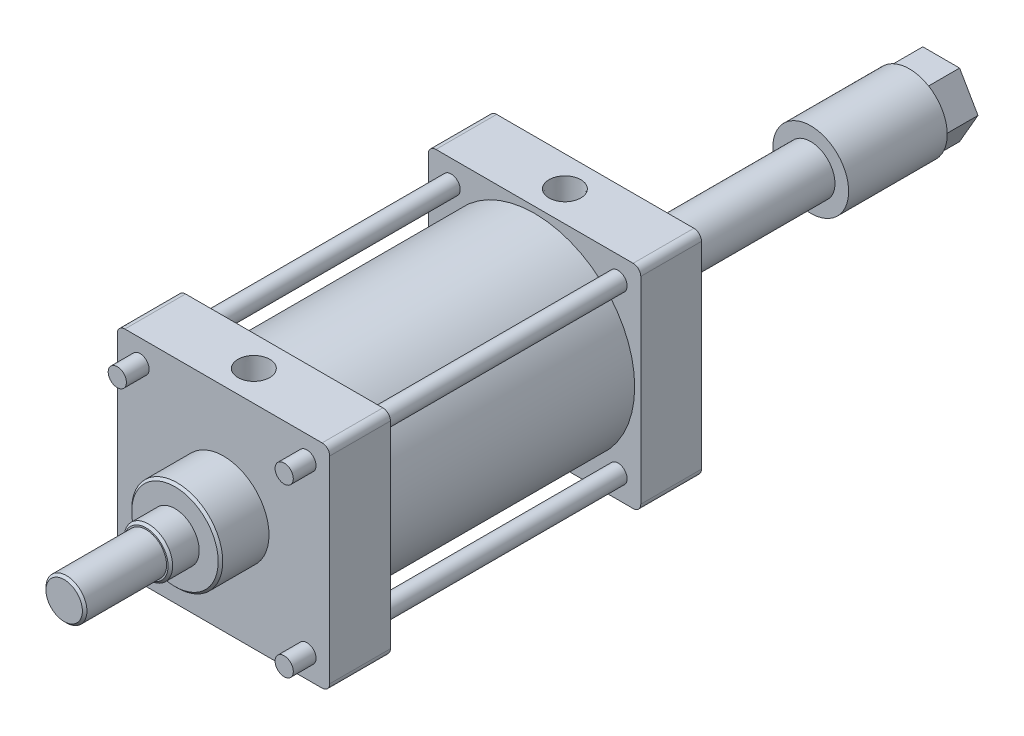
ISO-10303-21;
HEADER;
FILE_DESCRIPTION(('STEP AP214'),'2;1');
FILE_NAME('part.step','',(''),(''),'','','');
FILE_SCHEMA(('AUTOMOTIVE_DESIGN { 1 0 10303 214 1 1 1 1 }'));
ENDSEC;
DATA;
#1=APPLICATION_CONTEXT('core data for automotive mechanical design processes');
#2=APPLICATION_PROTOCOL_DEFINITION('international standard','automotive_design',2000,#1);
#3=PRODUCT_CONTEXT('',#1,'mechanical');
#4=PRODUCT('Part','Part','',(#3));
#5=PRODUCT_RELATED_PRODUCT_CATEGORY('part','',(#4));
#6=PRODUCT_DEFINITION_FORMATION('','',#4);
#7=PRODUCT_DEFINITION_CONTEXT('part definition',#1,'design');
#8=PRODUCT_DEFINITION('design','',#6,#7);
#9=PRODUCT_DEFINITION_SHAPE('','',#8);
#10=(LENGTH_UNIT() NAMED_UNIT(*) SI_UNIT(.MILLI.,.METRE.));
#11=(NAMED_UNIT(*) PLANE_ANGLE_UNIT() SI_UNIT($,.RADIAN.));
#12=(NAMED_UNIT(*) SI_UNIT($,.STERADIAN.) SOLID_ANGLE_UNIT());
#13=UNCERTAINTY_MEASURE_WITH_UNIT(LENGTH_MEASURE(1.E-05),#10,'distance_accuracy_value','');
#14=(GEOMETRIC_REPRESENTATION_CONTEXT(3) GLOBAL_UNCERTAINTY_ASSIGNED_CONTEXT((#13)) GLOBAL_UNIT_ASSIGNED_CONTEXT((#10,
#11,#12)) REPRESENTATION_CONTEXT('',''));
#15=CARTESIAN_POINT('',(0.,0.,0.));
#16=DIRECTION('',(0.,0.,1.));
#17=DIRECTION('',(1.,0.,0.));
#18=AXIS2_PLACEMENT_3D('',#15,#16,#17);
#19=CARTESIAN_POINT('',(-65.,-65.,-205.));
#20=DIRECTION('',(0.,0.,-1.));
#21=DIRECTION('',(-1.,0.,0.));
#22=AXIS2_PLACEMENT_3D('',#19,#20,#21);
#23=PLANE('',#22);
#24=CARTESIAN_POINT('',(-55.0000000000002,-54.9999999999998,-205.));
#25=DIRECTION('',(0.,0.,-1.));
#26=DIRECTION('',(-1.,0.,0.));
#27=AXIS2_PLACEMENT_3D('',#24,#25,#26);
#28=CIRCLE('',#27,6.);
#29=CARTESIAN_POINT('',(-61.0000000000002,-54.9999999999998,-205.));
#30=VERTEX_POINT('',#29);
#31=EDGE_CURVE('E11',#30,#30,#28,.F.);
#32=ORIENTED_EDGE('',*,*,#31,.F.);
#33=EDGE_LOOP('',(#32));
#34=FACE_BOUND('',#33,.T.);
#35=ADVANCED_FACE('F44',(#34),#23,.T.);
#36=CARTESIAN_POINT('',(-55.0000000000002,-54.9999999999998,-221.970562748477));
#37=DIRECTION('',(0.,0.,1.));
#38=DIRECTION('',(1.,0.,0.));
#39=AXIS2_PLACEMENT_3D('',#36,#37,#38);
#40=CYLINDRICAL_SURFACE('',#39,6.);
#41=ORIENTED_EDGE('',*,*,#31,.T.);
#42=EDGE_LOOP('',(#41));
#43=FACE_BOUND('',#42,.T.);
#44=CARTESIAN_POINT('',(-55.0000000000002,-54.9999999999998,55.));
#45=DIRECTION('',(0.,0.,1.));
#46=DIRECTION('',(1.,0.,0.));
#47=AXIS2_PLACEMENT_3D('',#44,#45,#46);
#48=CIRCLE('',#47,6.);
#49=CARTESIAN_POINT('',(-49.0000000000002,-54.9999999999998,55.));
#50=VERTEX_POINT('',#49);
#51=EDGE_CURVE('E50',#50,#50,#48,.T.);
#52=ORIENTED_EDGE('',*,*,#51,.F.);
#53=EDGE_LOOP('',(#52));
#54=FACE_BOUND('',#53,.T.);
#55=ADVANCED_FACE('F58',(#43,#54),#40,.T.);
#56=CARTESIAN_POINT('',(-55.0000000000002,-54.9999999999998,55.));
#57=DIRECTION('',(0.,0.,1.));
#58=DIRECTION('',(1.,0.,0.));
#59=AXIS2_PLACEMENT_3D('',#56,#57,#58);
#60=PLANE('',#59);
#61=ORIENTED_EDGE('',*,*,#51,.T.);
#62=EDGE_LOOP('',(#61));
#63=FACE_BOUND('',#62,.T.);
#64=ADVANCED_FACE('F56',(#63),#60,.T.);
#65=CLOSED_SHELL('',(#35,#55,#64));
#66=MANIFOLD_SOLID_BREP('B2',#65);
#67=CARTESIAN_POINT('',(-65.,-65.,-205.));
#68=DIRECTION('',(0.,0.,-1.));
#69=DIRECTION('',(-1.,0.,0.));
#70=AXIS2_PLACEMENT_3D('',#67,#68,#69);
#71=PLANE('',#70);
#72=CARTESIAN_POINT('',(-54.9999999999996,55.0000000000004,-205.));
#73=DIRECTION('',(0.,0.,-1.));
#74=DIRECTION('',(-1.,0.,0.));
#75=AXIS2_PLACEMENT_3D('',#72,#73,#74);
#76=CIRCLE('',#75,5.99999999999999);
#77=CARTESIAN_POINT('',(-60.9999999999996,55.0000000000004,-205.));
#78=VERTEX_POINT('',#77);
#79=EDGE_CURVE('E43',#78,#78,#76,.F.);
#80=ORIENTED_EDGE('',*,*,#79,.F.);
#81=EDGE_LOOP('',(#80));
#82=FACE_BOUND('',#81,.T.);
#83=ADVANCED_FACE('F93',(#82),#71,.T.);
#84=CARTESIAN_POINT('',(-54.9999999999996,55.0000000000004,-221.970562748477));
#85=DIRECTION('',(0.,0.,1.));
#86=DIRECTION('',(1.,0.,0.));
#87=AXIS2_PLACEMENT_3D('',#84,#85,#86);
#88=CYLINDRICAL_SURFACE('',#87,5.99999999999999);
#89=ORIENTED_EDGE('',*,*,#79,.T.);
#90=EDGE_LOOP('',(#89));
#91=FACE_BOUND('',#90,.T.);
#92=CARTESIAN_POINT('',(-54.9999999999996,55.0000000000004,55.));
#93=DIRECTION('',(0.,0.,1.));
#94=DIRECTION('',(1.,0.,0.));
#95=AXIS2_PLACEMENT_3D('',#92,#93,#94);
#96=CIRCLE('',#95,5.99999999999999);
#97=CARTESIAN_POINT('',(-48.9999999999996,55.0000000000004,55.));
#98=VERTEX_POINT('',#97);
#99=EDGE_CURVE('E99',#98,#98,#96,.T.);
#100=ORIENTED_EDGE('',*,*,#99,.F.);
#101=EDGE_LOOP('',(#100));
#102=FACE_BOUND('',#101,.T.);
#103=ADVANCED_FACE('F107',(#91,#102),#88,.T.);
#104=CARTESIAN_POINT('',(-54.9999999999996,55.0000000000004,55.));
#105=DIRECTION('',(0.,0.,1.));
#106=DIRECTION('',(1.,0.,0.));
#107=AXIS2_PLACEMENT_3D('',#104,#105,#106);
#108=PLANE('',#107);
#109=ORIENTED_EDGE('',*,*,#99,.T.);
#110=EDGE_LOOP('',(#109));
#111=FACE_BOUND('',#110,.T.);
#112=ADVANCED_FACE('F105',(#111),#108,.T.);
#113=CLOSED_SHELL('',(#83,#103,#112));
#114=MANIFOLD_SOLID_BREP('B6',#113);
#115=CARTESIAN_POINT('',(-65.,-65.,-205.));
#116=DIRECTION('',(0.,0.,-1.));
#117=DIRECTION('',(-1.,0.,0.));
#118=AXIS2_PLACEMENT_3D('',#115,#116,#117);
#119=PLANE('',#118);
#120=CARTESIAN_POINT('',(55.,-55.,-205.));
#121=DIRECTION('',(0.,0.,-1.));
#122=DIRECTION('',(-1.,0.,0.));
#123=AXIS2_PLACEMENT_3D('',#120,#121,#122);
#124=CIRCLE('',#123,6.);
#125=CARTESIAN_POINT('',(49.,-55.,-205.));
#126=VERTEX_POINT('',#125);
#127=EDGE_CURVE('E92',#126,#126,#124,.F.);
#128=ORIENTED_EDGE('',*,*,#127,.F.);
#129=EDGE_LOOP('',(#128));
#130=FACE_BOUND('',#129,.T.);
#131=ADVANCED_FACE('F142',(#130),#119,.T.);
#132=CARTESIAN_POINT('',(55.,-55.,-221.970562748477));
#133=DIRECTION('',(0.,0.,1.));
#134=DIRECTION('',(1.,0.,0.));
#135=AXIS2_PLACEMENT_3D('',#132,#133,#134);
#136=CYLINDRICAL_SURFACE('',#135,6.);
#137=ORIENTED_EDGE('',*,*,#127,.T.);
#138=EDGE_LOOP('',(#137));
#139=FACE_BOUND('',#138,.T.);
#140=CARTESIAN_POINT('',(55.,-55.,55.));
#141=DIRECTION('',(0.,0.,1.));
#142=DIRECTION('',(1.,0.,0.));
#143=AXIS2_PLACEMENT_3D('',#140,#141,#142);
#144=CIRCLE('',#143,6.);
#145=CARTESIAN_POINT('',(61.,-55.,55.));
#146=VERTEX_POINT('',#145);
#147=EDGE_CURVE('E148',#146,#146,#144,.T.);
#148=ORIENTED_EDGE('',*,*,#147,.F.);
#149=EDGE_LOOP('',(#148));
#150=FACE_BOUND('',#149,.T.);
#151=ADVANCED_FACE('F156',(#139,#150),#136,.T.);
#152=CARTESIAN_POINT('',(55.,-55.,55.));
#153=DIRECTION('',(0.,0.,1.));
#154=DIRECTION('',(1.,0.,0.));
#155=AXIS2_PLACEMENT_3D('',#152,#153,#154);
#156=PLANE('',#155);
#157=ORIENTED_EDGE('',*,*,#147,.T.);
#158=EDGE_LOOP('',(#157));
#159=FACE_BOUND('',#158,.T.);
#160=ADVANCED_FACE('F154',(#159),#156,.T.);
#161=CLOSED_SHELL('',(#131,#151,#160));
#162=MANIFOLD_SOLID_BREP('B38',#161);
#163=CARTESIAN_POINT('',(-65.,-65.,-205.));
#164=DIRECTION('',(0.,0.,-1.));
#165=DIRECTION('',(-1.,0.,0.));
#166=AXIS2_PLACEMENT_3D('',#163,#164,#165);
#167=PLANE('',#166);
#168=CARTESIAN_POINT('',(55.0000000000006,54.9999999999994,-205.));
#169=DIRECTION('',(0.,0.,-1.));
#170=DIRECTION('',(-1.,0.,0.));
#171=AXIS2_PLACEMENT_3D('',#168,#169,#170);
#172=CIRCLE('',#171,6.);
#173=CARTESIAN_POINT('',(49.0000000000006,54.9999999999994,-205.));
#174=VERTEX_POINT('',#173);
#175=EDGE_CURVE('E141',#174,#174,#172,.F.);
#176=ORIENTED_EDGE('',*,*,#175,.F.);
#177=EDGE_LOOP('',(#176));
#178=FACE_BOUND('',#177,.T.);
#179=ADVANCED_FACE('F192',(#178),#167,.T.);
#180=CARTESIAN_POINT('',(55.0000000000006,54.9999999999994,-221.970562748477));
#181=DIRECTION('',(0.,0.,1.));
#182=DIRECTION('',(1.,0.,0.));
#183=AXIS2_PLACEMENT_3D('',#180,#181,#182);
#184=CYLINDRICAL_SURFACE('',#183,6.);
#185=ORIENTED_EDGE('',*,*,#175,.T.);
#186=EDGE_LOOP('',(#185));
#187=FACE_BOUND('',#186,.T.);
#188=CARTESIAN_POINT('',(55.0000000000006,54.9999999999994,55.));
#189=DIRECTION('',(0.,0.,1.));
#190=DIRECTION('',(1.,0.,0.));
#191=AXIS2_PLACEMENT_3D('',#188,#189,#190);
#192=CIRCLE('',#191,6.);
#193=CARTESIAN_POINT('',(61.0000000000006,54.9999999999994,55.));
#194=VERTEX_POINT('',#193);
#195=EDGE_CURVE('E198',#194,#194,#192,.T.);
#196=ORIENTED_EDGE('',*,*,#195,.F.);
#197=EDGE_LOOP('',(#196));
#198=FACE_BOUND('',#197,.T.);
#199=ADVANCED_FACE('F206',(#187,#198),#184,.T.);
#200=CARTESIAN_POINT('',(55.0000000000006,54.9999999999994,55.));
#201=DIRECTION('',(0.,0.,1.));
#202=DIRECTION('',(1.,0.,0.));
#203=AXIS2_PLACEMENT_3D('',#200,#201,#202);
#204=PLANE('',#203);
#205=ORIENTED_EDGE('',*,*,#195,.T.);
#206=EDGE_LOOP('',(#205));
#207=FACE_BOUND('',#206,.T.);
#208=ADVANCED_FACE('F204',(#207),#204,.T.);
#209=CLOSED_SHELL('',(#179,#199,#208));
#210=MANIFOLD_SOLID_BREP('B87',#209);
#211=CARTESIAN_POINT('',(0.,0.,-412.));
#212=DIRECTION('',(0.,0.,-1.));
#213=DIRECTION('',(-1.,0.,0.));
#214=AXIS2_PLACEMENT_3D('',#211,#212,#213);
#215=PLANE('',#214);
#216=CARTESIAN_POINT('',(0.,0.,-412.));
#217=DIRECTION('',(0.,0.,-1.));
#218=DIRECTION('',(-1.,0.,0.));
#219=AXIS2_PLACEMENT_3D('',#216,#217,#218);
#220=CIRCLE('',#219,25.);
#221=CARTESIAN_POINT('',(-25.,0.,-412.));
#222=VERTEX_POINT('',#221);
#223=EDGE_CURVE('E942',#222,#222,#220,.T.);
#224=ORIENTED_EDGE('',*,*,#223,.T.);
#225=EDGE_LOOP('',(#224));
#226=FACE_BOUND('',#225,.T.);
#227=DIRECTION('',(0.5,0.866025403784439,0.));
#228=VECTOR('',#227,1.);
#229=CARTESIAN_POINT('',(-24.2487113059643,0.,-412.));
#230=LINE('',#229,#228);
#231=CARTESIAN_POINT('',(-24.2487113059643,0.,-412.));
#232=VERTEX_POINT('',#231);
#233=CARTESIAN_POINT('',(-12.1243556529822,21.,-412.));
#234=VERTEX_POINT('',#233);
#235=EDGE_CURVE('E918',#232,#234,#230,.T.);
#236=ORIENTED_EDGE('',*,*,#235,.F.);
#237=DIRECTION('',(-0.5,0.866025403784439,0.));
#238=VECTOR('',#237,1.);
#239=CARTESIAN_POINT('',(-12.1243556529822,-21.,-412.));
#240=LINE('',#239,#238);
#241=CARTESIAN_POINT('',(-12.1243556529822,-21.,-412.));
#242=VERTEX_POINT('',#241);
#243=EDGE_CURVE('E900',#242,#232,#240,.T.);
#244=ORIENTED_EDGE('',*,*,#243,.F.);
#245=DIRECTION('',(-1.,0.,0.));
#246=VECTOR('',#245,1.);
#247=CARTESIAN_POINT('',(12.1243556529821,-21.,-412.));
#248=LINE('',#247,#246);
#249=CARTESIAN_POINT('',(12.1243556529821,-21.,-412.));
#250=VERTEX_POINT('',#249);
#251=EDGE_CURVE('E905',#250,#242,#248,.T.);
#252=ORIENTED_EDGE('',*,*,#251,.F.);
#253=DIRECTION('',(-0.5,-0.866025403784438,0.));
#254=VECTOR('',#253,1.);
#255=CARTESIAN_POINT('',(24.2487113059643,0.,-412.));
#256=LINE('',#255,#254);
#257=CARTESIAN_POINT('',(24.2487113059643,0.,-412.));
#258=VERTEX_POINT('',#257);
#259=EDGE_CURVE('E924',#258,#250,#256,.T.);
#260=ORIENTED_EDGE('',*,*,#259,.F.);
#261=DIRECTION('',(0.5,-0.866025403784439,0.));
#262=VECTOR('',#261,1.);
#263=CARTESIAN_POINT('',(12.1243556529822,21.,-412.));
#264=LINE('',#263,#262);
#265=CARTESIAN_POINT('',(12.1243556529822,21.,-412.));
#266=VERTEX_POINT('',#265);
#267=EDGE_CURVE('E922',#266,#258,#264,.T.);
#268=ORIENTED_EDGE('',*,*,#267,.F.);
#269=DIRECTION('',(1.,0.,0.));
#270=VECTOR('',#269,1.);
#271=CARTESIAN_POINT('',(-12.1243556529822,21.,-412.));
#272=LINE('',#271,#270);
#273=EDGE_CURVE('E920',#234,#266,#272,.T.);
#274=ORIENTED_EDGE('',*,*,#273,.F.);
#275=EDGE_LOOP('',(#236,#244,#252,#260,#268,#274));
#276=FACE_BOUND('',#275,.T.);
#277=ADVANCED_FACE('F232',(#226,#276),#215,.T.);
#278=CARTESIAN_POINT('',(-65.,-65.,40.));
#279=DIRECTION('',(0.,0.,1.));
#280=DIRECTION('',(1.,0.,0.));
#281=AXIS2_PLACEMENT_3D('',#278,#279,#280);
#282=PLANE('',#281);
#283=CARTESIAN_POINT('',(0.,0.,40.));
#284=DIRECTION('',(0.,0.,1.));
#285=DIRECTION('',(1.,0.,0.));
#286=AXIS2_PLACEMENT_3D('',#283,#284,#285);
#287=CIRCLE('',#286,30.);
#288=CARTESIAN_POINT('',(30.,0.,40.));
#289=VERTEX_POINT('',#288);
#290=EDGE_CURVE('E611',#289,#289,#287,.T.);
#291=ORIENTED_EDGE('',*,*,#290,.F.);
#292=EDGE_LOOP('',(#291));
#293=FACE_BOUND('',#292,.T.);
#294=CARTESIAN_POINT('',(-54.9999999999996,55.0000000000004,40.));
#295=DIRECTION('',(0.,0.,1.));
#296=DIRECTION('',(1.,0.,0.));
#297=AXIS2_PLACEMENT_3D('',#294,#295,#296);
#298=CIRCLE('',#297,6.);
#299=CARTESIAN_POINT('',(-48.9999999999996,55.0000000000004,40.));
#300=VERTEX_POINT('',#299);
#301=EDGE_CURVE('E720',#300,#300,#298,.T.);
#302=ORIENTED_EDGE('',*,*,#301,.F.);
#303=EDGE_LOOP('',(#302));
#304=FACE_BOUND('',#303,.T.);
#305=CARTESIAN_POINT('',(55.,-55.,40.));
#306=DIRECTION('',(0.,0.,1.));
#307=DIRECTION('',(1.,0.,0.));
#308=AXIS2_PLACEMENT_3D('',#305,#306,#307);
#309=CIRCLE('',#308,6.);
#310=CARTESIAN_POINT('',(61.,-55.,40.));
#311=VERTEX_POINT('',#310);
#312=EDGE_CURVE('E347',#311,#311,#309,.T.);
#313=ORIENTED_EDGE('',*,*,#312,.F.);
#314=EDGE_LOOP('',(#313));
#315=FACE_BOUND('',#314,.T.);
#316=CARTESIAN_POINT('',(-65.,-65.,40.));
#317=DIRECTION('',(0.,0.,1.));
#318=DIRECTION('',(1.,0.,0.));
#319=AXIS2_PLACEMENT_3D('',#316,#317,#318);
#320=CIRCLE('',#319,5.);
#321=CARTESIAN_POINT('',(-70.,-65.,40.));
#322=VERTEX_POINT('',#321);
#323=CARTESIAN_POINT('',(-65.,-70.,40.));
#324=VERTEX_POINT('',#323);
#325=EDGE_CURVE('E359',#322,#324,#320,.T.);
#326=ORIENTED_EDGE('',*,*,#325,.T.);
#327=DIRECTION('',(1.,0.,0.));
#328=VECTOR('',#327,1.);
#329=CARTESIAN_POINT('',(65.,-70.,40.));
#330=LINE('',#329,#328);
#331=CARTESIAN_POINT('',(65.,-70.,40.));
#332=VERTEX_POINT('',#331);
#333=EDGE_CURVE('E298',#324,#332,#330,.T.);
#334=ORIENTED_EDGE('',*,*,#333,.T.);
#335=CARTESIAN_POINT('',(65.,-65.,40.));
#336=DIRECTION('',(0.,0.,1.));
#337=DIRECTION('',(-1.,0.,0.));
#338=AXIS2_PLACEMENT_3D('',#335,#336,#337);
#339=CIRCLE('',#338,5.);
#340=CARTESIAN_POINT('',(70.,-65.,40.));
#341=VERTEX_POINT('',#340);
#342=EDGE_CURVE('E738',#332,#341,#339,.T.);
#343=ORIENTED_EDGE('',*,*,#342,.T.);
#344=DIRECTION('',(0.,1.,0.));
#345=VECTOR('',#344,1.);
#346=CARTESIAN_POINT('',(70.,65.,40.));
#347=LINE('',#346,#345);
#348=CARTESIAN_POINT('',(70.,65.,40.));
#349=VERTEX_POINT('',#348);
#350=EDGE_CURVE('E740',#341,#349,#347,.T.);
#351=ORIENTED_EDGE('',*,*,#350,.T.);
#352=CARTESIAN_POINT('',(65.,65.,40.));
#353=DIRECTION('',(0.,0.,1.));
#354=DIRECTION('',(-1.,0.,0.));
#355=AXIS2_PLACEMENT_3D('',#352,#353,#354);
#356=CIRCLE('',#355,5.);
#357=CARTESIAN_POINT('',(65.,70.,40.));
#358=VERTEX_POINT('',#357);
#359=EDGE_CURVE('E322',#349,#358,#356,.T.);
#360=ORIENTED_EDGE('',*,*,#359,.T.);
#361=DIRECTION('',(-1.,0.,0.));
#362=VECTOR('',#361,1.);
#363=CARTESIAN_POINT('',(65.,70.,40.));
#364=LINE('',#363,#362);
#365=CARTESIAN_POINT('',(-65.,70.,40.));
#366=VERTEX_POINT('',#365);
#367=EDGE_CURVE('E314',#358,#366,#364,.T.);
#368=ORIENTED_EDGE('',*,*,#367,.T.);
#369=CARTESIAN_POINT('',(-65.,65.,40.));
#370=DIRECTION('',(0.,0.,1.));
#371=DIRECTION('',(-1.,0.,0.));
#372=AXIS2_PLACEMENT_3D('',#369,#370,#371);
#373=CIRCLE('',#372,5.);
#374=CARTESIAN_POINT('',(-70.,65.,40.));
#375=VERTEX_POINT('',#374);
#376=EDGE_CURVE('E319',#366,#375,#373,.T.);
#377=ORIENTED_EDGE('',*,*,#376,.T.);
#378=DIRECTION('',(0.,-1.,0.));
#379=VECTOR('',#378,1.);
#380=CARTESIAN_POINT('',(-70.,65.,40.));
#381=LINE('',#380,#379);
#382=EDGE_CURVE('E256',#375,#322,#381,.T.);
#383=ORIENTED_EDGE('',*,*,#382,.T.);
#384=EDGE_LOOP('',(#326,#334,#343,#351,#360,#368,#377,#383));
#385=FACE_BOUND('',#384,.T.);
#386=CARTESIAN_POINT('',(-55.0000000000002,-54.9999999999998,40.));
#387=DIRECTION('',(0.,0.,1.));
#388=DIRECTION('',(1.,0.,0.));
#389=AXIS2_PLACEMENT_3D('',#386,#387,#388);
#390=CIRCLE('',#389,6.);
#391=CARTESIAN_POINT('',(-49.0000000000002,-54.9999999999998,40.));
#392=VERTEX_POINT('',#391);
#393=EDGE_CURVE('E726',#392,#392,#390,.T.);
#394=ORIENTED_EDGE('',*,*,#393,.F.);
#395=EDGE_LOOP('',(#394));
#396=FACE_BOUND('',#395,.T.);
#397=CARTESIAN_POINT('',(55.0000000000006,54.9999999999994,40.));
#398=DIRECTION('',(0.,0.,1.));
#399=DIRECTION('',(1.,0.,0.));
#400=AXIS2_PLACEMENT_3D('',#397,#398,#399);
#401=CIRCLE('',#400,6.);
#402=CARTESIAN_POINT('',(61.0000000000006,54.9999999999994,40.));
#403=VERTEX_POINT('',#402);
#404=EDGE_CURVE('E714',#403,#403,#401,.T.);
#405=ORIENTED_EDGE('',*,*,#404,.F.);
#406=EDGE_LOOP('',(#405));
#407=FACE_BOUND('',#406,.T.);
#408=ADVANCED_FACE('F316',(#293,#304,#315,#385,#396,#407),#282,.T.);
#409=CARTESIAN_POINT('',(-65.,-65.,0.));
#410=DIRECTION('',(0.,0.,1.));
#411=DIRECTION('',(1.,0.,0.));
#412=AXIS2_PLACEMENT_3D('',#409,#410,#411);
#413=PLANE('',#412);
#414=CARTESIAN_POINT('',(0.,0.,0.));
#415=DIRECTION('',(0.,0.,1.));
#416=DIRECTION('',(1.,0.,0.));
#417=AXIS2_PLACEMENT_3D('',#414,#415,#416);
#418=CIRCLE('',#417,66.);
#419=CARTESIAN_POINT('',(66.,0.,0.));
#420=VERTEX_POINT('',#419);
#421=EDGE_CURVE('E374',#420,#420,#418,.F.);
#422=ORIENTED_EDGE('',*,*,#421,.F.);
#423=EDGE_LOOP('',(#422));
#424=FACE_BOUND('',#423,.T.);
#425=CARTESIAN_POINT('',(-65.,-65.,0.));
#426=DIRECTION('',(0.,0.,1.));
#427=DIRECTION('',(1.,0.,0.));
#428=AXIS2_PLACEMENT_3D('',#425,#426,#427);
#429=CIRCLE('',#428,5.);
#430=CARTESIAN_POINT('',(-70.,-65.,0.));
#431=VERTEX_POINT('',#430);
#432=CARTESIAN_POINT('',(-65.,-70.,0.));
#433=VERTEX_POINT('',#432);
#434=EDGE_CURVE('E343',#431,#433,#429,.T.);
#435=ORIENTED_EDGE('',*,*,#434,.F.);
#436=DIRECTION('',(0.,-1.,0.));
#437=VECTOR('',#436,1.);
#438=CARTESIAN_POINT('',(-70.,65.,0.));
#439=LINE('',#438,#437);
#440=CARTESIAN_POINT('',(-70.,65.,0.));
#441=VERTEX_POINT('',#440);
#442=EDGE_CURVE('E289',#441,#431,#439,.T.);
#443=ORIENTED_EDGE('',*,*,#442,.F.);
#444=CARTESIAN_POINT('',(-65.,65.,0.));
#445=DIRECTION('',(0.,0.,1.));
#446=DIRECTION('',(-1.,0.,0.));
#447=AXIS2_PLACEMENT_3D('',#444,#445,#446);
#448=CIRCLE('',#447,5.);
#449=CARTESIAN_POINT('',(-65.,70.,0.));
#450=VERTEX_POINT('',#449);
#451=EDGE_CURVE('E356',#450,#441,#448,.T.);
#452=ORIENTED_EDGE('',*,*,#451,.F.);
#453=DIRECTION('',(-1.,0.,0.));
#454=VECTOR('',#453,1.);
#455=CARTESIAN_POINT('',(65.,70.,0.));
#456=LINE('',#455,#454);
#457=CARTESIAN_POINT('',(65.,70.,0.));
#458=VERTEX_POINT('',#457);
#459=EDGE_CURVE('E331',#458,#450,#456,.T.);
#460=ORIENTED_EDGE('',*,*,#459,.F.);
#461=CARTESIAN_POINT('',(65.,65.,0.));
#462=DIRECTION('',(0.,0.,1.));
#463=DIRECTION('',(-1.,0.,0.));
#464=AXIS2_PLACEMENT_3D('',#461,#462,#463);
#465=CIRCLE('',#464,5.);
#466=CARTESIAN_POINT('',(70.,65.,0.));
#467=VERTEX_POINT('',#466);
#468=EDGE_CURVE('E353',#467,#458,#465,.T.);
#469=ORIENTED_EDGE('',*,*,#468,.F.);
#470=DIRECTION('',(0.,1.,0.));
#471=VECTOR('',#470,1.);
#472=CARTESIAN_POINT('',(70.,65.,0.));
#473=LINE('',#472,#471);
#474=CARTESIAN_POINT('',(70.,-65.,0.));
#475=VERTEX_POINT('',#474);
#476=EDGE_CURVE('E351',#475,#467,#473,.T.);
#477=ORIENTED_EDGE('',*,*,#476,.F.);
#478=CARTESIAN_POINT('',(65.,-65.,0.));
#479=DIRECTION('',(0.,0.,1.));
#480=DIRECTION('',(-1.,0.,0.));
#481=AXIS2_PLACEMENT_3D('',#478,#479,#480);
#482=CIRCLE('',#481,5.);
#483=CARTESIAN_POINT('',(65.,-70.,0.));
#484=VERTEX_POINT('',#483);
#485=EDGE_CURVE('E349',#484,#475,#482,.T.);
#486=ORIENTED_EDGE('',*,*,#485,.F.);
#487=DIRECTION('',(1.,0.,0.));
#488=VECTOR('',#487,1.);
#489=CARTESIAN_POINT('',(65.,-70.,0.));
#490=LINE('',#489,#488);
#491=EDGE_CURVE('E346',#433,#484,#490,.T.);
#492=ORIENTED_EDGE('',*,*,#491,.F.);
#493=EDGE_LOOP('',(#435,#443,#452,#460,#469,#477,#486,#492));
#494=FACE_BOUND('',#493,.T.);
#495=CARTESIAN_POINT('',(55.,-55.,0.));
#496=DIRECTION('',(0.,0.,1.));
#497=DIRECTION('',(1.,0.,0.));
#498=AXIS2_PLACEMENT_3D('',#495,#496,#497);
#499=CIRCLE('',#498,6.);
#500=CARTESIAN_POINT('',(61.,-55.,0.));
#501=VERTEX_POINT('',#500);
#502=EDGE_CURVE('E729',#501,#501,#499,.T.);
#503=ORIENTED_EDGE('',*,*,#502,.T.);
#504=EDGE_LOOP('',(#503));
#505=FACE_BOUND('',#504,.T.);
#506=CARTESIAN_POINT('',(-55.0000000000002,-54.9999999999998,0.));
#507=DIRECTION('',(0.,0.,1.));
#508=DIRECTION('',(1.,0.,0.));
#509=AXIS2_PLACEMENT_3D('',#506,#507,#508);
#510=CIRCLE('',#509,6.);
#511=CARTESIAN_POINT('',(-49.0000000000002,-54.9999999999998,0.));
#512=VERTEX_POINT('',#511);
#513=EDGE_CURVE('E723',#512,#512,#510,.T.);
#514=ORIENTED_EDGE('',*,*,#513,.T.);
#515=EDGE_LOOP('',(#514));
#516=FACE_BOUND('',#515,.T.);
#517=CARTESIAN_POINT('',(-54.9999999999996,55.0000000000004,0.));
#518=DIRECTION('',(0.,0.,1.));
#519=DIRECTION('',(1.,0.,0.));
#520=AXIS2_PLACEMENT_3D('',#517,#518,#519);
#521=CIRCLE('',#520,6.);
#522=CARTESIAN_POINT('',(-48.9999999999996,55.0000000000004,0.));
#523=VERTEX_POINT('',#522);
#524=EDGE_CURVE('E717',#523,#523,#521,.T.);
#525=ORIENTED_EDGE('',*,*,#524,.T.);
#526=EDGE_LOOP('',(#525));
#527=FACE_BOUND('',#526,.T.);
#528=CARTESIAN_POINT('',(55.0000000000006,54.9999999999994,0.));
#529=DIRECTION('',(0.,0.,1.));
#530=DIRECTION('',(1.,0.,0.));
#531=AXIS2_PLACEMENT_3D('',#528,#529,#530);
#532=CIRCLE('',#531,6.);
#533=CARTESIAN_POINT('',(61.0000000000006,54.9999999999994,0.));
#534=VERTEX_POINT('',#533);
#535=EDGE_CURVE('E713',#534,#534,#532,.T.);
#536=ORIENTED_EDGE('',*,*,#535,.T.);
#537=EDGE_LOOP('',(#536));
#538=FACE_BOUND('',#537,.T.);
#539=ADVANCED_FACE('F421',(#424,#494,#505,#516,#527,#538),#413,.F.);
#540=CARTESIAN_POINT('',(-65.,-65.,40.));
#541=DIRECTION('',(0.,0.,-1.));
#542=DIRECTION('',(-1.,0.,0.));
#543=AXIS2_PLACEMENT_3D('',#540,#541,#542);
#544=CYLINDRICAL_SURFACE('',#543,5.);
#545=ORIENTED_EDGE('',*,*,#434,.T.);
#546=DIRECTION('',(0.,0.,-1.));
#547=VECTOR('',#546,1.);
#548=CARTESIAN_POINT('',(-65.,-70.,40.));
#549=LINE('',#548,#547);
#550=EDGE_CURVE('E372',#324,#433,#549,.T.);
#551=ORIENTED_EDGE('',*,*,#550,.F.);
#552=ORIENTED_EDGE('',*,*,#325,.F.);
#553=DIRECTION('',(0.,0.,-1.));
#554=VECTOR('',#553,1.);
#555=CARTESIAN_POINT('',(-70.,-65.,40.));
#556=LINE('',#555,#554);
#557=EDGE_CURVE('E339',#322,#431,#556,.T.);
#558=ORIENTED_EDGE('',*,*,#557,.T.);
#559=EDGE_LOOP('',(#545,#551,#552,#558));
#560=FACE_BOUND('',#559,.T.);
#561=ADVANCED_FACE('F556',(#560),#544,.T.);
#562=CARTESIAN_POINT('',(65.,-70.,40.));
#563=DIRECTION('',(0.,1.,0.));
#564=DIRECTION('',(-1.,0.,0.));
#565=AXIS2_PLACEMENT_3D('',#562,#563,#564);
#566=PLANE('',#565);
#567=ORIENTED_EDGE('',*,*,#491,.T.);
#568=DIRECTION('',(0.,0.,-1.));
#569=VECTOR('',#568,1.);
#570=CARTESIAN_POINT('',(65.,-70.,40.));
#571=LINE('',#570,#569);
#572=EDGE_CURVE('E369',#332,#484,#571,.T.);
#573=ORIENTED_EDGE('',*,*,#572,.F.);
#574=ORIENTED_EDGE('',*,*,#333,.F.);
#575=ORIENTED_EDGE('',*,*,#550,.T.);
#576=EDGE_LOOP('',(#567,#573,#574,#575));
#577=FACE_BOUND('',#576,.T.);
#578=ADVANCED_FACE('F576',(#577),#566,.F.);
#579=CARTESIAN_POINT('',(65.,-65.,40.));
#580=DIRECTION('',(0.,0.,-1.));
#581=DIRECTION('',(-1.,0.,0.));
#582=AXIS2_PLACEMENT_3D('',#579,#580,#581);
#583=CYLINDRICAL_SURFACE('',#582,5.);
#584=ORIENTED_EDGE('',*,*,#485,.T.);
#585=DIRECTION('',(0.,0.,-1.));
#586=VECTOR('',#585,1.);
#587=CARTESIAN_POINT('',(70.,-65.,40.));
#588=LINE('',#587,#586);
#589=EDGE_CURVE('E366',#341,#475,#588,.T.);
#590=ORIENTED_EDGE('',*,*,#589,.F.);
#591=ORIENTED_EDGE('',*,*,#342,.F.);
#592=ORIENTED_EDGE('',*,*,#572,.T.);
#593=EDGE_LOOP('',(#584,#590,#591,#592));
#594=FACE_BOUND('',#593,.T.);
#595=ADVANCED_FACE('F572',(#594),#583,.T.);
#596=CARTESIAN_POINT('',(70.,65.,40.));
#597=DIRECTION('',(-1.,0.,0.));
#598=DIRECTION('',(0.,0.,1.));
#599=AXIS2_PLACEMENT_3D('',#596,#597,#598);
#600=PLANE('',#599);
#601=ORIENTED_EDGE('',*,*,#476,.T.);
#602=DIRECTION('',(0.,0.,-1.));
#603=VECTOR('',#602,1.);
#604=CARTESIAN_POINT('',(70.,65.,40.));
#605=LINE('',#604,#603);
#606=EDGE_CURVE('E363',#349,#467,#605,.T.);
#607=ORIENTED_EDGE('',*,*,#606,.F.);
#608=ORIENTED_EDGE('',*,*,#350,.F.);
#609=ORIENTED_EDGE('',*,*,#589,.T.);
#610=EDGE_LOOP('',(#601,#607,#608,#609));
#611=FACE_BOUND('',#610,.T.);
#612=ADVANCED_FACE('F568',(#611),#600,.F.);
#613=CARTESIAN_POINT('',(65.,65.,40.));
#614=DIRECTION('',(0.,0.,-1.));
#615=DIRECTION('',(-1.,0.,0.));
#616=AXIS2_PLACEMENT_3D('',#613,#614,#615);
#617=CYLINDRICAL_SURFACE('',#616,5.);
#618=ORIENTED_EDGE('',*,*,#468,.T.);
#619=DIRECTION('',(0.,0.,-1.));
#620=VECTOR('',#619,1.);
#621=CARTESIAN_POINT('',(65.,70.,40.));
#622=LINE('',#621,#620);
#623=EDGE_CURVE('E334',#358,#458,#622,.T.);
#624=ORIENTED_EDGE('',*,*,#623,.F.);
#625=ORIENTED_EDGE('',*,*,#359,.F.);
#626=ORIENTED_EDGE('',*,*,#606,.T.);
#627=EDGE_LOOP('',(#618,#624,#625,#626));
#628=FACE_BOUND('',#627,.T.);
#629=ADVANCED_FACE('F564',(#628),#617,.T.);
#630=CARTESIAN_POINT('',(65.,70.,40.));
#631=DIRECTION('',(0.,-1.,0.));
#632=DIRECTION('',(1.,0.,0.));
#633=AXIS2_PLACEMENT_3D('',#630,#631,#632);
#634=PLANE('',#633);
#635=CARTESIAN_POINT('',(0.,70.,20.));
#636=DIRECTION('',(0.,1.,0.));
#637=DIRECTION('',(0.,0.,1.));
#638=AXIS2_PLACEMENT_3D('',#635,#636,#637);
#639=CIRCLE('',#638,10.4775);
#640=CARTESIAN_POINT('',(0.,70.,30.4775));
#641=VERTEX_POINT('',#640);
#642=EDGE_CURVE('E1376',#641,#641,#639,.T.);
#643=ORIENTED_EDGE('',*,*,#642,.F.);
#644=EDGE_LOOP('',(#643));
#645=FACE_BOUND('',#644,.T.);
#646=ORIENTED_EDGE('',*,*,#459,.T.);
#647=DIRECTION('',(0.,0.,-1.));
#648=VECTOR('',#647,1.);
#649=CARTESIAN_POINT('',(-65.,70.,40.));
#650=LINE('',#649,#648);
#651=EDGE_CURVE('E328',#366,#450,#650,.T.);
#652=ORIENTED_EDGE('',*,*,#651,.F.);
#653=ORIENTED_EDGE('',*,*,#367,.F.);
#654=ORIENTED_EDGE('',*,*,#623,.T.);
#655=EDGE_LOOP('',(#646,#652,#653,#654));
#656=FACE_BOUND('',#655,.T.);
#657=ADVANCED_FACE('F329',(#645,#656),#634,.F.);
#658=CARTESIAN_POINT('',(-65.,65.,40.));
#659=DIRECTION('',(0.,0.,-1.));
#660=DIRECTION('',(-1.,0.,0.));
#661=AXIS2_PLACEMENT_3D('',#658,#659,#660);
#662=CYLINDRICAL_SURFACE('',#661,5.);
#663=ORIENTED_EDGE('',*,*,#451,.T.);
#664=DIRECTION('',(0.,0.,-1.));
#665=VECTOR('',#664,1.);
#666=CARTESIAN_POINT('',(-70.,65.,40.));
#667=LINE('',#666,#665);
#668=EDGE_CURVE('E335',#375,#441,#667,.T.);
#669=ORIENTED_EDGE('',*,*,#668,.F.);
#670=ORIENTED_EDGE('',*,*,#376,.F.);
#671=ORIENTED_EDGE('',*,*,#651,.T.);
#672=EDGE_LOOP('',(#663,#669,#670,#671));
#673=FACE_BOUND('',#672,.T.);
#674=ADVANCED_FACE('F337',(#673),#662,.T.);
#675=CARTESIAN_POINT('',(-70.,65.,40.));
#676=DIRECTION('',(1.,0.,0.));
#677=DIRECTION('',(0.,1.,0.));
#678=AXIS2_PLACEMENT_3D('',#675,#676,#677);
#679=PLANE('',#678);
#680=ORIENTED_EDGE('',*,*,#442,.T.);
#681=ORIENTED_EDGE('',*,*,#557,.F.);
#682=ORIENTED_EDGE('',*,*,#382,.F.);
#683=ORIENTED_EDGE('',*,*,#668,.T.);
#684=EDGE_LOOP('',(#680,#681,#682,#683));
#685=FACE_BOUND('',#684,.T.);
#686=ADVANCED_FACE('F551',(#685),#679,.F.);
#687=CARTESIAN_POINT('',(55.,-55.,40.));
#688=DIRECTION('',(0.,0.,-1.));
#689=DIRECTION('',(-1.,0.,0.));
#690=AXIS2_PLACEMENT_3D('',#687,#688,#689);
#691=CYLINDRICAL_SURFACE('',#690,6.);
#692=ORIENTED_EDGE('',*,*,#312,.T.);
#693=EDGE_LOOP('',(#692));
#694=FACE_BOUND('',#693,.T.);
#695=ORIENTED_EDGE('',*,*,#502,.F.);
#696=EDGE_LOOP('',(#695));
#697=FACE_BOUND('',#696,.T.);
#698=ADVANCED_FACE('F548',(#694,#697),#691,.F.);
#699=CARTESIAN_POINT('',(-55.0000000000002,-54.9999999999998,40.));
#700=DIRECTION('',(0.,0.,-1.));
#701=DIRECTION('',(-1.,0.,0.));
#702=AXIS2_PLACEMENT_3D('',#699,#700,#701);
#703=CYLINDRICAL_SURFACE('',#702,6.);
#704=ORIENTED_EDGE('',*,*,#393,.T.);
#705=EDGE_LOOP('',(#704));
#706=FACE_BOUND('',#705,.T.);
#707=ORIENTED_EDGE('',*,*,#513,.F.);
#708=EDGE_LOOP('',(#707));
#709=FACE_BOUND('',#708,.T.);
#710=ADVANCED_FACE('F544',(#706,#709),#703,.F.);
#711=CARTESIAN_POINT('',(-54.9999999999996,55.0000000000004,40.));
#712=DIRECTION('',(0.,0.,-1.));
#713=DIRECTION('',(-1.,0.,0.));
#714=AXIS2_PLACEMENT_3D('',#711,#712,#713);
#715=CYLINDRICAL_SURFACE('',#714,6.);
#716=ORIENTED_EDGE('',*,*,#301,.T.);
#717=EDGE_LOOP('',(#716));
#718=FACE_BOUND('',#717,.T.);
#719=ORIENTED_EDGE('',*,*,#524,.F.);
#720=EDGE_LOOP('',(#719));
#721=FACE_BOUND('',#720,.T.);
#722=ADVANCED_FACE('F540',(#718,#721),#715,.F.);
#723=CARTESIAN_POINT('',(55.0000000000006,54.9999999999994,40.));
#724=DIRECTION('',(0.,0.,-1.));
#725=DIRECTION('',(-1.,0.,0.));
#726=AXIS2_PLACEMENT_3D('',#723,#724,#725);
#727=CYLINDRICAL_SURFACE('',#726,6.);
#728=ORIENTED_EDGE('',*,*,#404,.T.);
#729=EDGE_LOOP('',(#728));
#730=FACE_BOUND('',#729,.T.);
#731=ORIENTED_EDGE('',*,*,#535,.F.);
#732=EDGE_LOOP('',(#731));
#733=FACE_BOUND('',#732,.T.);
#734=ADVANCED_FACE('F536',(#730,#733),#727,.F.);
#735=CARTESIAN_POINT('',(0.,0.,-165.));
#736=DIRECTION('',(0.,0.,1.));
#737=DIRECTION('',(1.,0.,0.));
#738=AXIS2_PLACEMENT_3D('',#735,#736,#737);
#739=CYLINDRICAL_SURFACE('',#738,66.);
#740=CARTESIAN_POINT('',(0.,0.,-165.));
#741=DIRECTION('',(0.,0.,-1.));
#742=DIRECTION('',(-1.,0.,0.));
#743=AXIS2_PLACEMENT_3D('',#740,#741,#742);
#744=CIRCLE('',#743,66.);
#745=CARTESIAN_POINT('',(-66.,0.,-165.));
#746=VERTEX_POINT('',#745);
#747=EDGE_CURVE('E710',#746,#746,#744,.T.);
#748=ORIENTED_EDGE('',*,*,#747,.F.);
#749=EDGE_LOOP('',(#748));
#750=FACE_BOUND('',#749,.T.);
#751=ORIENTED_EDGE('',*,*,#421,.T.);
#752=EDGE_LOOP('',(#751));
#753=FACE_BOUND('',#752,.T.);
#754=ADVANCED_FACE('F498',(#750,#753),#739,.T.);
#755=CARTESIAN_POINT('',(-65.,-65.,-205.));
#756=DIRECTION('',(0.,0.,-1.));
#757=DIRECTION('',(-1.,0.,0.));
#758=AXIS2_PLACEMENT_3D('',#755,#756,#757);
#759=PLANE('',#758);
#760=CARTESIAN_POINT('',(0.,0.,-205.));
#761=DIRECTION('',(0.,0.,-1.));
#762=DIRECTION('',(-1.,0.,0.));
#763=AXIS2_PLACEMENT_3D('',#760,#761,#762);
#764=CIRCLE('',#763,30.);
#765=CARTESIAN_POINT('',(-30.,0.,-205.));
#766=VERTEX_POINT('',#765);
#767=EDGE_CURVE('E602',#766,#766,#764,.T.);
#768=ORIENTED_EDGE('',*,*,#767,.F.);
#769=EDGE_LOOP('',(#768));
#770=FACE_BOUND('',#769,.T.);
#771=CARTESIAN_POINT('',(-54.9999999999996,55.0000000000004,-205.));
#772=DIRECTION('',(0.,0.,-1.));
#773=DIRECTION('',(-1.,0.,0.));
#774=AXIS2_PLACEMENT_3D('',#771,#772,#773);
#775=CIRCLE('',#774,5.99999999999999);
#776=CARTESIAN_POINT('',(-60.9999999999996,55.0000000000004,-205.));
#777=VERTEX_POINT('',#776);
#778=EDGE_CURVE('E621',#777,#777,#775,.T.);
#779=ORIENTED_EDGE('',*,*,#778,.F.);
#780=EDGE_LOOP('',(#779));
#781=FACE_BOUND('',#780,.T.);
#782=CARTESIAN_POINT('',(-55.0000000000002,-54.9999999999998,-205.));
#783=DIRECTION('',(0.,0.,-1.));
#784=DIRECTION('',(-1.,0.,0.));
#785=AXIS2_PLACEMENT_3D('',#782,#783,#784);
#786=CIRCLE('',#785,6.);
#787=CARTESIAN_POINT('',(-61.0000000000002,-54.9999999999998,-205.));
#788=VERTEX_POINT('',#787);
#789=EDGE_CURVE('E633',#788,#788,#786,.T.);
#790=ORIENTED_EDGE('',*,*,#789,.F.);
#791=EDGE_LOOP('',(#790));
#792=FACE_BOUND('',#791,.T.);
#793=CARTESIAN_POINT('',(-65.,-65.,-205.));
#794=DIRECTION('',(0.,0.,-1.));
#795=DIRECTION('',(-1.,0.,0.));
#796=AXIS2_PLACEMENT_3D('',#793,#794,#795);
#797=CIRCLE('',#796,5.);
#798=CARTESIAN_POINT('',(-65.,-70.,-205.));
#799=VERTEX_POINT('',#798);
#800=CARTESIAN_POINT('',(-70.,-65.,-205.));
#801=VERTEX_POINT('',#800);
#802=EDGE_CURVE('E639',#799,#801,#797,.T.);
#803=ORIENTED_EDGE('',*,*,#802,.T.);
#804=DIRECTION('',(0.,1.,0.));
#805=VECTOR('',#804,1.);
#806=CARTESIAN_POINT('',(-70.,-65.,-205.));
#807=LINE('',#806,#805);
#808=CARTESIAN_POINT('',(-70.,65.,-205.));
#809=VERTEX_POINT('',#808);
#810=EDGE_CURVE('E642',#801,#809,#807,.T.);
#811=ORIENTED_EDGE('',*,*,#810,.T.);
#812=CARTESIAN_POINT('',(-65.,65.,-205.));
#813=DIRECTION('',(0.,0.,-1.));
#814=DIRECTION('',(-1.,0.,0.));
#815=AXIS2_PLACEMENT_3D('',#812,#813,#814);
#816=CIRCLE('',#815,5.);
#817=CARTESIAN_POINT('',(-65.,70.,-205.));
#818=VERTEX_POINT('',#817);
#819=EDGE_CURVE('E646',#809,#818,#816,.T.);
#820=ORIENTED_EDGE('',*,*,#819,.T.);
#821=DIRECTION('',(1.,0.,0.));
#822=VECTOR('',#821,1.);
#823=CARTESIAN_POINT('',(-65.,70.,-205.));
#824=LINE('',#823,#822);
#825=CARTESIAN_POINT('',(65.,70.,-205.));
#826=VERTEX_POINT('',#825);
#827=EDGE_CURVE('E649',#818,#826,#824,.T.);
#828=ORIENTED_EDGE('',*,*,#827,.T.);
#829=CARTESIAN_POINT('',(65.,65.,-205.));
#830=DIRECTION('',(0.,0.,-1.));
#831=DIRECTION('',(-1.,0.,0.));
#832=AXIS2_PLACEMENT_3D('',#829,#830,#831);
#833=CIRCLE('',#832,5.);
#834=CARTESIAN_POINT('',(70.,65.,-205.));
#835=VERTEX_POINT('',#834);
#836=EDGE_CURVE('E652',#826,#835,#833,.T.);
#837=ORIENTED_EDGE('',*,*,#836,.T.);
#838=DIRECTION('',(0.,-1.,0.));
#839=VECTOR('',#838,1.);
#840=CARTESIAN_POINT('',(70.,65.,-205.));
#841=LINE('',#840,#839);
#842=CARTESIAN_POINT('',(70.,-65.,-205.));
#843=VERTEX_POINT('',#842);
#844=EDGE_CURVE('E655',#835,#843,#841,.T.);
#845=ORIENTED_EDGE('',*,*,#844,.T.);
#846=CARTESIAN_POINT('',(65.,-65.,-205.));
#847=DIRECTION('',(0.,0.,-1.));
#848=DIRECTION('',(-1.,0.,0.));
#849=AXIS2_PLACEMENT_3D('',#846,#847,#848);
#850=CIRCLE('',#849,5.);
#851=CARTESIAN_POINT('',(65.,-70.,-205.));
#852=VERTEX_POINT('',#851);
#853=EDGE_CURVE('E658',#843,#852,#850,.T.);
#854=ORIENTED_EDGE('',*,*,#853,.T.);
#855=DIRECTION('',(-1.,0.,0.));
#856=VECTOR('',#855,1.);
#857=CARTESIAN_POINT('',(65.,-70.,-205.));
#858=LINE('',#857,#856);
#859=EDGE_CURVE('E661',#852,#799,#858,.T.);
#860=ORIENTED_EDGE('',*,*,#859,.T.);
#861=EDGE_LOOP('',(#803,#811,#820,#828,#837,#845,#854,#860));
#862=FACE_BOUND('',#861,.T.);
#863=CARTESIAN_POINT('',(55.,-55.,-205.));
#864=DIRECTION('',(0.,0.,-1.));
#865=DIRECTION('',(-1.,0.,0.));
#866=AXIS2_PLACEMENT_3D('',#863,#864,#865);
#867=CIRCLE('',#866,6.);
#868=CARTESIAN_POINT('',(49.,-55.,-205.));
#869=VERTEX_POINT('',#868);
#870=EDGE_CURVE('E627',#869,#869,#867,.T.);
#871=ORIENTED_EDGE('',*,*,#870,.F.);
#872=EDGE_LOOP('',(#871));
#873=FACE_BOUND('',#872,.T.);
#874=CARTESIAN_POINT('',(55.0000000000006,54.9999999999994,-205.));
#875=DIRECTION('',(0.,0.,-1.));
#876=DIRECTION('',(-1.,0.,0.));
#877=AXIS2_PLACEMENT_3D('',#874,#875,#876);
#878=CIRCLE('',#877,6.);
#879=CARTESIAN_POINT('',(49.0000000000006,54.9999999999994,-205.));
#880=VERTEX_POINT('',#879);
#881=EDGE_CURVE('E615',#880,#880,#878,.T.);
#882=ORIENTED_EDGE('',*,*,#881,.F.);
#883=EDGE_LOOP('',(#882));
#884=FACE_BOUND('',#883,.T.);
#885=ADVANCED_FACE('F494',(#770,#781,#792,#862,#873,#884),#759,.T.);
#886=CARTESIAN_POINT('',(-65.,-65.,-165.));
#887=DIRECTION('',(0.,0.,-1.));
#888=DIRECTION('',(-1.,0.,0.));
#889=AXIS2_PLACEMENT_3D('',#886,#887,#888);
#890=PLANE('',#889);
#891=ORIENTED_EDGE('',*,*,#747,.T.);
#892=EDGE_LOOP('',(#891));
#893=FACE_BOUND('',#892,.T.);
#894=CARTESIAN_POINT('',(-65.,-65.,-165.));
#895=DIRECTION('',(0.,0.,-1.));
#896=DIRECTION('',(-1.,0.,0.));
#897=AXIS2_PLACEMENT_3D('',#894,#895,#896);
#898=CIRCLE('',#897,5.);
#899=CARTESIAN_POINT('',(-65.,-70.,-165.));
#900=VERTEX_POINT('',#899);
#901=CARTESIAN_POINT('',(-70.,-65.,-165.));
#902=VERTEX_POINT('',#901);
#903=EDGE_CURVE('E636',#900,#902,#898,.T.);
#904=ORIENTED_EDGE('',*,*,#903,.F.);
#905=DIRECTION('',(-1.,0.,0.));
#906=VECTOR('',#905,1.);
#907=CARTESIAN_POINT('',(65.,-70.,-165.));
#908=LINE('',#907,#906);
#909=CARTESIAN_POINT('',(65.,-70.,-165.));
#910=VERTEX_POINT('',#909);
#911=EDGE_CURVE('E643',#910,#900,#908,.T.);
#912=ORIENTED_EDGE('',*,*,#911,.F.);
#913=CARTESIAN_POINT('',(65.,-65.,-165.));
#914=DIRECTION('',(0.,0.,-1.));
#915=DIRECTION('',(-1.,0.,0.));
#916=AXIS2_PLACEMENT_3D('',#913,#914,#915);
#917=CIRCLE('',#916,5.);
#918=CARTESIAN_POINT('',(70.,-65.,-165.));
#919=VERTEX_POINT('',#918);
#920=EDGE_CURVE('E682',#919,#910,#917,.T.);
#921=ORIENTED_EDGE('',*,*,#920,.F.);
#922=DIRECTION('',(0.,-1.,0.));
#923=VECTOR('',#922,1.);
#924=CARTESIAN_POINT('',(70.,65.,-165.));
#925=LINE('',#924,#923);
#926=CARTESIAN_POINT('',(70.,65.,-165.));
#927=VERTEX_POINT('',#926);
#928=EDGE_CURVE('E679',#927,#919,#925,.T.);
#929=ORIENTED_EDGE('',*,*,#928,.F.);
#930=CARTESIAN_POINT('',(65.,65.,-165.));
#931=DIRECTION('',(0.,0.,-1.));
#932=DIRECTION('',(-1.,0.,0.));
#933=AXIS2_PLACEMENT_3D('',#930,#931,#932);
#934=CIRCLE('',#933,5.);
#935=CARTESIAN_POINT('',(65.,70.,-165.));
#936=VERTEX_POINT('',#935);
#937=EDGE_CURVE('E676',#936,#927,#934,.T.);
#938=ORIENTED_EDGE('',*,*,#937,.F.);
#939=DIRECTION('',(1.,0.,0.));
#940=VECTOR('',#939,1.);
#941=CARTESIAN_POINT('',(-65.,70.,-165.));
#942=LINE('',#941,#940);
#943=CARTESIAN_POINT('',(-65.,70.,-165.));
#944=VERTEX_POINT('',#943);
#945=EDGE_CURVE('E673',#944,#936,#942,.T.);
#946=ORIENTED_EDGE('',*,*,#945,.F.);
#947=CARTESIAN_POINT('',(-65.,65.,-165.));
#948=DIRECTION('',(0.,0.,-1.));
#949=DIRECTION('',(-1.,0.,0.));
#950=AXIS2_PLACEMENT_3D('',#947,#948,#949);
#951=CIRCLE('',#950,5.);
#952=CARTESIAN_POINT('',(-70.,65.,-165.));
#953=VERTEX_POINT('',#952);
#954=EDGE_CURVE('E670',#953,#944,#951,.T.);
#955=ORIENTED_EDGE('',*,*,#954,.F.);
#956=DIRECTION('',(0.,1.,0.));
#957=VECTOR('',#956,1.);
#958=CARTESIAN_POINT('',(-70.,-65.,-165.));
#959=LINE('',#958,#957);
#960=EDGE_CURVE('E667',#902,#953,#959,.T.);
#961=ORIENTED_EDGE('',*,*,#960,.F.);
#962=EDGE_LOOP('',(#904,#912,#921,#929,#938,#946,#955,#961));
#963=FACE_BOUND('',#962,.T.);
#964=CARTESIAN_POINT('',(-55.0000000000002,-54.9999999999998,-165.));
#965=DIRECTION('',(0.,0.,-1.));
#966=DIRECTION('',(-1.,0.,0.));
#967=AXIS2_PLACEMENT_3D('',#964,#965,#966);
#968=CIRCLE('',#967,6.);
#969=CARTESIAN_POINT('',(-61.0000000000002,-54.9999999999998,-165.));
#970=VERTEX_POINT('',#969);
#971=EDGE_CURVE('E630',#970,#970,#968,.T.);
#972=ORIENTED_EDGE('',*,*,#971,.T.);
#973=EDGE_LOOP('',(#972));
#974=FACE_BOUND('',#973,.T.);
#975=CARTESIAN_POINT('',(55.,-55.,-165.));
#976=DIRECTION('',(0.,0.,-1.));
#977=DIRECTION('',(-1.,0.,0.));
#978=AXIS2_PLACEMENT_3D('',#975,#976,#977);
#979=CIRCLE('',#978,6.);
#980=CARTESIAN_POINT('',(49.,-55.,-165.));
#981=VERTEX_POINT('',#980);
#982=EDGE_CURVE('E624',#981,#981,#979,.T.);
#983=ORIENTED_EDGE('',*,*,#982,.T.);
#984=EDGE_LOOP('',(#983));
#985=FACE_BOUND('',#984,.T.);
#986=CARTESIAN_POINT('',(-54.9999999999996,55.0000000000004,-165.));
#987=DIRECTION('',(0.,0.,-1.));
#988=DIRECTION('',(-1.,0.,0.));
#989=AXIS2_PLACEMENT_3D('',#986,#987,#988);
#990=CIRCLE('',#989,5.99999999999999);
#991=CARTESIAN_POINT('',(-60.9999999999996,55.0000000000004,-165.));
#992=VERTEX_POINT('',#991);
#993=EDGE_CURVE('E618',#992,#992,#990,.T.);
#994=ORIENTED_EDGE('',*,*,#993,.T.);
#995=EDGE_LOOP('',(#994));
#996=FACE_BOUND('',#995,.T.);
#997=CARTESIAN_POINT('',(55.0000000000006,54.9999999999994,-165.));
#998=DIRECTION('',(0.,0.,-1.));
#999=DIRECTION('',(-1.,0.,0.));
#1000=AXIS2_PLACEMENT_3D('',#997,#998,#999);
#1001=CIRCLE('',#1000,6.);
#1002=CARTESIAN_POINT('',(49.0000000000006,54.9999999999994,-165.));
#1003=VERTEX_POINT('',#1002);
#1004=EDGE_CURVE('E614',#1003,#1003,#1001,.T.);
#1005=ORIENTED_EDGE('',*,*,#1004,.T.);
#1006=EDGE_LOOP('',(#1005));
#1007=FACE_BOUND('',#1006,.T.);
#1008=ADVANCED_FACE('F497',(#893,#963,#974,#985,#996,#1007),#890,.F.);
#1009=CARTESIAN_POINT('',(-65.,-65.,-205.));
#1010=DIRECTION('',(0.,0.,1.));
#1011=DIRECTION('',(1.,0.,0.));
#1012=AXIS2_PLACEMENT_3D('',#1009,#1010,#1011);
#1013=CYLINDRICAL_SURFACE('',#1012,5.);
#1014=ORIENTED_EDGE('',*,*,#903,.T.);
#1015=DIRECTION('',(0.,0.,1.));
#1016=VECTOR('',#1015,1.);
#1017=CARTESIAN_POINT('',(-70.,-65.,-205.));
#1018=LINE('',#1017,#1016);
#1019=EDGE_CURVE('E707',#801,#902,#1018,.T.);
#1020=ORIENTED_EDGE('',*,*,#1019,.F.);
#1021=ORIENTED_EDGE('',*,*,#802,.F.);
#1022=DIRECTION('',(0.,0.,1.));
#1023=VECTOR('',#1022,1.);
#1024=CARTESIAN_POINT('',(-65.,-70.,-205.));
#1025=LINE('',#1024,#1023);
#1026=EDGE_CURVE('E664',#799,#900,#1025,.T.);
#1027=ORIENTED_EDGE('',*,*,#1026,.T.);
#1028=EDGE_LOOP('',(#1014,#1020,#1021,#1027));
#1029=FACE_BOUND('',#1028,.T.);
#1030=ADVANCED_FACE('F502',(#1029),#1013,.T.);
#1031=CARTESIAN_POINT('',(-70.,-65.,-205.));
#1032=DIRECTION('',(1.,0.,0.));
#1033=DIRECTION('',(0.,1.,0.));
#1034=AXIS2_PLACEMENT_3D('',#1031,#1032,#1033);
#1035=PLANE('',#1034);
#1036=ORIENTED_EDGE('',*,*,#960,.T.);
#1037=DIRECTION('',(0.,0.,1.));
#1038=VECTOR('',#1037,1.);
#1039=CARTESIAN_POINT('',(-70.,65.,-205.));
#1040=LINE('',#1039,#1038);
#1041=EDGE_CURVE('E704',#809,#953,#1040,.T.);
#1042=ORIENTED_EDGE('',*,*,#1041,.F.);
#1043=ORIENTED_EDGE('',*,*,#810,.F.);
#1044=ORIENTED_EDGE('',*,*,#1019,.T.);
#1045=EDGE_LOOP('',(#1036,#1042,#1043,#1044));
#1046=FACE_BOUND('',#1045,.T.);
#1047=ADVANCED_FACE('F526',(#1046),#1035,.F.);
#1048=CARTESIAN_POINT('',(-65.,65.,-205.));
#1049=DIRECTION('',(0.,0.,1.));
#1050=DIRECTION('',(1.,0.,0.));
#1051=AXIS2_PLACEMENT_3D('',#1048,#1049,#1050);
#1052=CYLINDRICAL_SURFACE('',#1051,5.);
#1053=ORIENTED_EDGE('',*,*,#954,.T.);
#1054=DIRECTION('',(0.,0.,1.));
#1055=VECTOR('',#1054,1.);
#1056=CARTESIAN_POINT('',(-65.,70.,-205.));
#1057=LINE('',#1056,#1055);
#1058=EDGE_CURVE('E701',#818,#944,#1057,.T.);
#1059=ORIENTED_EDGE('',*,*,#1058,.F.);
#1060=ORIENTED_EDGE('',*,*,#819,.F.);
#1061=ORIENTED_EDGE('',*,*,#1041,.T.);
#1062=EDGE_LOOP('',(#1053,#1059,#1060,#1061));
#1063=FACE_BOUND('',#1062,.T.);
#1064=ADVANCED_FACE('F522',(#1063),#1052,.T.);
#1065=CARTESIAN_POINT('',(-65.,70.,-205.));
#1066=DIRECTION('',(0.,-1.,0.));
#1067=DIRECTION('',(1.,0.,0.));
#1068=AXIS2_PLACEMENT_3D('',#1065,#1066,#1067);
#1069=PLANE('',#1068);
#1070=CARTESIAN_POINT('',(0.,70.,-185.));
#1071=DIRECTION('',(0.,1.,0.));
#1072=DIRECTION('',(0.,0.,1.));
#1073=AXIS2_PLACEMENT_3D('',#1070,#1071,#1072);
#1074=CIRCLE('',#1073,10.4775);
#1075=CARTESIAN_POINT('',(0.,70.,-174.5225));
#1076=VERTEX_POINT('',#1075);
#1077=EDGE_CURVE('E881',#1076,#1076,#1074,.T.);
#1078=ORIENTED_EDGE('',*,*,#1077,.F.);
#1079=EDGE_LOOP('',(#1078));
#1080=FACE_BOUND('',#1079,.T.);
#1081=ORIENTED_EDGE('',*,*,#945,.T.);
#1082=DIRECTION('',(0.,0.,1.));
#1083=VECTOR('',#1082,1.);
#1084=CARTESIAN_POINT('',(65.,70.,-205.));
#1085=LINE('',#1084,#1083);
#1086=EDGE_CURVE('E698',#826,#936,#1085,.T.);
#1087=ORIENTED_EDGE('',*,*,#1086,.F.);
#1088=ORIENTED_EDGE('',*,*,#827,.F.);
#1089=ORIENTED_EDGE('',*,*,#1058,.T.);
#1090=EDGE_LOOP('',(#1081,#1087,#1088,#1089));
#1091=FACE_BOUND('',#1090,.T.);
#1092=ADVANCED_FACE('F518',(#1080,#1091),#1069,.F.);
#1093=CARTESIAN_POINT('',(65.,65.,-205.));
#1094=DIRECTION('',(0.,0.,1.));
#1095=DIRECTION('',(1.,0.,0.));
#1096=AXIS2_PLACEMENT_3D('',#1093,#1094,#1095);
#1097=CYLINDRICAL_SURFACE('',#1096,5.);
#1098=ORIENTED_EDGE('',*,*,#937,.T.);
#1099=DIRECTION('',(0.,0.,1.));
#1100=VECTOR('',#1099,1.);
#1101=CARTESIAN_POINT('',(70.,65.,-205.));
#1102=LINE('',#1101,#1100);
#1103=EDGE_CURVE('E695',#835,#927,#1102,.T.);
#1104=ORIENTED_EDGE('',*,*,#1103,.F.);
#1105=ORIENTED_EDGE('',*,*,#836,.F.);
#1106=ORIENTED_EDGE('',*,*,#1086,.T.);
#1107=EDGE_LOOP('',(#1098,#1104,#1105,#1106));
#1108=FACE_BOUND('',#1107,.T.);
#1109=ADVANCED_FACE('F514',(#1108),#1097,.T.);
#1110=CARTESIAN_POINT('',(70.,65.,-205.));
#1111=DIRECTION('',(-1.,0.,0.));
#1112=DIRECTION('',(0.,0.,1.));
#1113=AXIS2_PLACEMENT_3D('',#1110,#1111,#1112);
#1114=PLANE('',#1113);
#1115=ORIENTED_EDGE('',*,*,#928,.T.);
#1116=DIRECTION('',(0.,0.,1.));
#1117=VECTOR('',#1116,1.);
#1118=CARTESIAN_POINT('',(70.,-65.,-205.));
#1119=LINE('',#1118,#1117);
#1120=EDGE_CURVE('E692',#843,#919,#1119,.T.);
#1121=ORIENTED_EDGE('',*,*,#1120,.F.);
#1122=ORIENTED_EDGE('',*,*,#844,.F.);
#1123=ORIENTED_EDGE('',*,*,#1103,.T.);
#1124=EDGE_LOOP('',(#1115,#1121,#1122,#1123));
#1125=FACE_BOUND('',#1124,.T.);
#1126=ADVANCED_FACE('F510',(#1125),#1114,.F.);
#1127=CARTESIAN_POINT('',(65.,-65.,-205.));
#1128=DIRECTION('',(0.,0.,1.));
#1129=DIRECTION('',(1.,0.,0.));
#1130=AXIS2_PLACEMENT_3D('',#1127,#1128,#1129);
#1131=CYLINDRICAL_SURFACE('',#1130,5.);
#1132=ORIENTED_EDGE('',*,*,#920,.T.);
#1133=DIRECTION('',(0.,0.,1.));
#1134=VECTOR('',#1133,1.);
#1135=CARTESIAN_POINT('',(65.,-70.,-205.));
#1136=LINE('',#1135,#1134);
#1137=EDGE_CURVE('E689',#852,#910,#1136,.T.);
#1138=ORIENTED_EDGE('',*,*,#1137,.F.);
#1139=ORIENTED_EDGE('',*,*,#853,.F.);
#1140=ORIENTED_EDGE('',*,*,#1120,.T.);
#1141=EDGE_LOOP('',(#1132,#1138,#1139,#1140));
#1142=FACE_BOUND('',#1141,.T.);
#1143=ADVANCED_FACE('F506',(#1142),#1131,.T.);
#1144=CARTESIAN_POINT('',(65.,-70.,-205.));
#1145=DIRECTION('',(0.,1.,0.));
#1146=DIRECTION('',(-1.,0.,0.));
#1147=AXIS2_PLACEMENT_3D('',#1144,#1145,#1146);
#1148=PLANE('',#1147);
#1149=ORIENTED_EDGE('',*,*,#911,.T.);
#1150=ORIENTED_EDGE('',*,*,#1026,.F.);
#1151=ORIENTED_EDGE('',*,*,#859,.F.);
#1152=ORIENTED_EDGE('',*,*,#1137,.T.);
#1153=EDGE_LOOP('',(#1149,#1150,#1151,#1152));
#1154=FACE_BOUND('',#1153,.T.);
#1155=ADVANCED_FACE('F492',(#1154),#1148,.F.);
#1156=CARTESIAN_POINT('',(-55.0000000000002,-54.9999999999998,-205.));
#1157=DIRECTION('',(0.,0.,1.));
#1158=DIRECTION('',(1.,0.,0.));
#1159=AXIS2_PLACEMENT_3D('',#1156,#1157,#1158);
#1160=CYLINDRICAL_SURFACE('',#1159,6.);
#1161=ORIENTED_EDGE('',*,*,#789,.T.);
#1162=EDGE_LOOP('',(#1161));
#1163=FACE_BOUND('',#1162,.T.);
#1164=ORIENTED_EDGE('',*,*,#971,.F.);
#1165=EDGE_LOOP('',(#1164));
#1166=FACE_BOUND('',#1165,.T.);
#1167=ADVANCED_FACE('F488',(#1163,#1166),#1160,.F.);
#1168=CARTESIAN_POINT('',(55.,-55.,-205.));
#1169=DIRECTION('',(0.,0.,1.));
#1170=DIRECTION('',(1.,0.,0.));
#1171=AXIS2_PLACEMENT_3D('',#1168,#1169,#1170);
#1172=CYLINDRICAL_SURFACE('',#1171,6.);
#1173=ORIENTED_EDGE('',*,*,#870,.T.);
#1174=EDGE_LOOP('',(#1173));
#1175=FACE_BOUND('',#1174,.T.);
#1176=ORIENTED_EDGE('',*,*,#982,.F.);
#1177=EDGE_LOOP('',(#1176));
#1178=FACE_BOUND('',#1177,.T.);
#1179=ADVANCED_FACE('F484',(#1175,#1178),#1172,.F.);
#1180=CARTESIAN_POINT('',(-54.9999999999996,55.0000000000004,-205.));
#1181=DIRECTION('',(0.,0.,1.));
#1182=DIRECTION('',(1.,0.,0.));
#1183=AXIS2_PLACEMENT_3D('',#1180,#1181,#1182);
#1184=CYLINDRICAL_SURFACE('',#1183,5.99999999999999);
#1185=ORIENTED_EDGE('',*,*,#778,.T.);
#1186=EDGE_LOOP('',(#1185));
#1187=FACE_BOUND('',#1186,.T.);
#1188=ORIENTED_EDGE('',*,*,#993,.F.);
#1189=EDGE_LOOP('',(#1188));
#1190=FACE_BOUND('',#1189,.T.);
#1191=ADVANCED_FACE('F480',(#1187,#1190),#1184,.F.);
#1192=CARTESIAN_POINT('',(55.0000000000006,54.9999999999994,-205.));
#1193=DIRECTION('',(0.,0.,1.));
#1194=DIRECTION('',(1.,0.,0.));
#1195=AXIS2_PLACEMENT_3D('',#1192,#1193,#1194);
#1196=CYLINDRICAL_SURFACE('',#1195,6.);
#1197=ORIENTED_EDGE('',*,*,#881,.T.);
#1198=EDGE_LOOP('',(#1197));
#1199=FACE_BOUND('',#1198,.T.);
#1200=ORIENTED_EDGE('',*,*,#1004,.F.);
#1201=EDGE_LOOP('',(#1200));
#1202=FACE_BOUND('',#1201,.T.);
#1203=ADVANCED_FACE('F476',(#1199,#1202),#1196,.F.);
#1204=CARTESIAN_POINT('',(0.,0.,72.));
#1205=DIRECTION('',(0.,0.,-1.));
#1206=DIRECTION('',(-1.,0.,0.));
#1207=AXIS2_PLACEMENT_3D('',#1204,#1205,#1206);
#1208=CYLINDRICAL_SURFACE('',#1207,30.);
#1209=CARTESIAN_POINT('',(0.,0.,70.5));
#1210=DIRECTION('',(0.,0.,1.));
#1211=DIRECTION('',(1.,0.,0.));
#1212=AXIS2_PLACEMENT_3D('',#1209,#1210,#1211);
#1213=CIRCLE('',#1212,30.);
#1214=CARTESIAN_POINT('',(30.,0.,70.5));
#1215=VERTEX_POINT('',#1214);
#1216=EDGE_CURVE('E392',#1215,#1215,#1213,.F.);
#1217=ORIENTED_EDGE('',*,*,#1216,.T.);
#1218=EDGE_LOOP('',(#1217));
#1219=FACE_BOUND('',#1218,.T.);
#1220=ORIENTED_EDGE('',*,*,#290,.T.);
#1221=EDGE_LOOP('',(#1220));
#1222=FACE_BOUND('',#1221,.T.);
#1223=ADVANCED_FACE('F472',(#1219,#1222),#1208,.T.);
#1224=CARTESIAN_POINT('',(0.,0.,72.));
#1225=DIRECTION('',(0.,0.,1.));
#1226=DIRECTION('',(1.,0.,0.));
#1227=AXIS2_PLACEMENT_3D('',#1224,#1225,#1226);
#1228=PLANE('',#1227);
#1229=CARTESIAN_POINT('',(0.,0.,72.));
#1230=DIRECTION('',(0.,0.,1.));
#1231=DIRECTION('',(1.,0.,0.));
#1232=AXIS2_PLACEMENT_3D('',#1229,#1230,#1231);
#1233=CIRCLE('',#1232,28.5);
#1234=CARTESIAN_POINT('',(28.5,0.,72.));
#1235=VERTEX_POINT('',#1234);
#1236=EDGE_CURVE('E389',#1235,#1235,#1233,.T.);
#1237=ORIENTED_EDGE('',*,*,#1236,.T.);
#1238=EDGE_LOOP('',(#1237));
#1239=FACE_BOUND('',#1238,.T.);
#1240=CARTESIAN_POINT('',(0.,0.,72.));
#1241=DIRECTION('',(0.,0.,1.));
#1242=DIRECTION('',(1.,0.,0.));
#1243=AXIS2_PLACEMENT_3D('',#1240,#1241,#1242);
#1244=CIRCLE('',#1243,16.);
#1245=CARTESIAN_POINT('',(16.,0.,72.));
#1246=VERTEX_POINT('',#1245);
#1247=EDGE_CURVE('E598',#1246,#1246,#1244,.T.);
#1248=ORIENTED_EDGE('',*,*,#1247,.F.);
#1249=EDGE_LOOP('',(#1248));
#1250=FACE_BOUND('',#1249,.T.);
#1251=ADVANCED_FACE('F468',(#1239,#1250),#1228,.T.);
#1252=CARTESIAN_POINT('',(0.,0.,-237.));
#1253=DIRECTION('',(0.,0.,1.));
#1254=DIRECTION('',(1.,0.,0.));
#1255=AXIS2_PLACEMENT_3D('',#1252,#1253,#1254);
#1256=CYLINDRICAL_SURFACE('',#1255,30.);
#1257=CARTESIAN_POINT('',(0.,0.,-235.5));
#1258=DIRECTION('',(0.,0.,-1.));
#1259=DIRECTION('',(-1.,0.,0.));
#1260=AXIS2_PLACEMENT_3D('',#1257,#1258,#1259);
#1261=CIRCLE('',#1260,30.);
#1262=CARTESIAN_POINT('',(-30.,0.,-235.5));
#1263=VERTEX_POINT('',#1262);
#1264=EDGE_CURVE('E190',#1263,#1263,#1261,.F.);
#1265=ORIENTED_EDGE('',*,*,#1264,.T.);
#1266=EDGE_LOOP('',(#1265));
#1267=FACE_BOUND('',#1266,.T.);
#1268=ORIENTED_EDGE('',*,*,#767,.T.);
#1269=EDGE_LOOP('',(#1268));
#1270=FACE_BOUND('',#1269,.T.);
#1271=ADVANCED_FACE('F464',(#1267,#1270),#1256,.T.);
#1272=CARTESIAN_POINT('',(0.,0.,-237.));
#1273=DIRECTION('',(0.,0.,-1.));
#1274=DIRECTION('',(-1.,0.,0.));
#1275=AXIS2_PLACEMENT_3D('',#1272,#1273,#1274);
#1276=PLANE('',#1275);
#1277=CARTESIAN_POINT('',(0.,0.,-237.));
#1278=DIRECTION('',(0.,0.,-1.));
#1279=DIRECTION('',(-1.,0.,0.));
#1280=AXIS2_PLACEMENT_3D('',#1277,#1278,#1279);
#1281=CIRCLE('',#1280,25.);
#1282=CARTESIAN_POINT('',(-25.,0.,-237.));
#1283=VERTEX_POINT('',#1282);
#1284=EDGE_CURVE('E605',#1283,#1283,#1281,.T.);
#1285=ORIENTED_EDGE('',*,*,#1284,.F.);
#1286=EDGE_LOOP('',(#1285));
#1287=FACE_BOUND('',#1286,.T.);
#1288=CARTESIAN_POINT('',(0.,0.,-237.));
#1289=DIRECTION('',(0.,0.,-1.));
#1290=DIRECTION('',(-1.,0.,0.));
#1291=AXIS2_PLACEMENT_3D('',#1288,#1289,#1290);
#1292=CIRCLE('',#1291,28.5);
#1293=CARTESIAN_POINT('',(-28.5,0.,-237.));
#1294=VERTEX_POINT('',#1293);
#1295=EDGE_CURVE('E240',#1294,#1294,#1292,.T.);
#1296=ORIENTED_EDGE('',*,*,#1295,.T.);
#1297=EDGE_LOOP('',(#1296));
#1298=FACE_BOUND('',#1297,.T.);
#1299=ADVANCED_FACE('F397',(#1287,#1298),#1276,.T.);
#1300=CARTESIAN_POINT('',(0.,0.,91.));
#1301=DIRECTION('',(0.,0.,-1.));
#1302=DIRECTION('',(-1.,0.,0.));
#1303=AXIS2_PLACEMENT_3D('',#1300,#1301,#1302);
#1304=CYLINDRICAL_SURFACE('',#1303,16.);
#1305=CARTESIAN_POINT('',(0.,0.,89.5));
#1306=DIRECTION('',(0.,0.,1.));
#1307=DIRECTION('',(1.,0.,0.));
#1308=AXIS2_PLACEMENT_3D('',#1305,#1306,#1307);
#1309=CIRCLE('',#1308,16.);
#1310=CARTESIAN_POINT('',(16.,0.,89.5));
#1311=VERTEX_POINT('',#1310);
#1312=EDGE_CURVE('E386',#1311,#1311,#1309,.F.);
#1313=ORIENTED_EDGE('',*,*,#1312,.T.);
#1314=EDGE_LOOP('',(#1313));
#1315=FACE_BOUND('',#1314,.T.);
#1316=ORIENTED_EDGE('',*,*,#1247,.T.);
#1317=EDGE_LOOP('',(#1316));
#1318=FACE_BOUND('',#1317,.T.);
#1319=ADVANCED_FACE('F457',(#1315,#1318),#1304,.T.);
#1320=CARTESIAN_POINT('',(0.,0.,91.));
#1321=DIRECTION('',(0.,0.,1.));
#1322=DIRECTION('',(1.,0.,0.));
#1323=AXIS2_PLACEMENT_3D('',#1320,#1321,#1322);
#1324=PLANE('',#1323);
#1325=CARTESIAN_POINT('',(0.,0.,91.));
#1326=DIRECTION('',(0.,0.,1.));
#1327=DIRECTION('',(1.,0.,0.));
#1328=AXIS2_PLACEMENT_3D('',#1325,#1326,#1327);
#1329=CIRCLE('',#1328,14.5);
#1330=CARTESIAN_POINT('',(14.5,0.,91.));
#1331=VERTEX_POINT('',#1330);
#1332=EDGE_CURVE('E383',#1331,#1331,#1329,.T.);
#1333=ORIENTED_EDGE('',*,*,#1332,.T.);
#1334=EDGE_LOOP('',(#1333));
#1335=FACE_BOUND('',#1334,.T.);
#1336=CARTESIAN_POINT('',(0.,0.,91.));
#1337=DIRECTION('',(0.,0.,1.));
#1338=DIRECTION('',(1.,0.,0.));
#1339=AXIS2_PLACEMENT_3D('',#1336,#1337,#1338);
#1340=CIRCLE('',#1339,13.5);
#1341=CARTESIAN_POINT('',(13.5,0.,91.));
#1342=VERTEX_POINT('',#1341);
#1343=EDGE_CURVE('E596',#1342,#1342,#1340,.T.);
#1344=ORIENTED_EDGE('',*,*,#1343,.F.);
#1345=EDGE_LOOP('',(#1344));
#1346=FACE_BOUND('',#1345,.T.);
#1347=ADVANCED_FACE('F453',(#1335,#1346),#1324,.T.);
#1348=CARTESIAN_POINT('',(0.,0.,145.));
#1349=DIRECTION('',(0.,0.,-1.));
#1350=DIRECTION('',(-1.,0.,0.));
#1351=AXIS2_PLACEMENT_3D('',#1348,#1349,#1350);
#1352=CYLINDRICAL_SURFACE('',#1351,13.5);
#1353=CARTESIAN_POINT('',(0.,0.,143.5));
#1354=DIRECTION('',(0.,0.,1.));
#1355=DIRECTION('',(1.,0.,0.));
#1356=AXIS2_PLACEMENT_3D('',#1353,#1354,#1355);
#1357=CIRCLE('',#1356,13.5);
#1358=CARTESIAN_POINT('',(13.5,0.,143.5));
#1359=VERTEX_POINT('',#1358);
#1360=EDGE_CURVE('E380',#1359,#1359,#1357,.F.);
#1361=ORIENTED_EDGE('',*,*,#1360,.T.);
#1362=EDGE_LOOP('',(#1361));
#1363=FACE_BOUND('',#1362,.T.);
#1364=ORIENTED_EDGE('',*,*,#1343,.T.);
#1365=EDGE_LOOP('',(#1364));
#1366=FACE_BOUND('',#1365,.T.);
#1367=ADVANCED_FACE('F449',(#1363,#1366),#1352,.T.);
#1368=CARTESIAN_POINT('',(0.,0.,145.));
#1369=DIRECTION('',(0.,0.,1.));
#1370=DIRECTION('',(1.,0.,0.));
#1371=AXIS2_PLACEMENT_3D('',#1368,#1369,#1370);
#1372=PLANE('',#1371);
#1373=CARTESIAN_POINT('',(0.,0.,145.));
#1374=DIRECTION('',(0.,0.,1.));
#1375=DIRECTION('',(1.,0.,0.));
#1376=AXIS2_PLACEMENT_3D('',#1373,#1374,#1375);
#1377=CIRCLE('',#1376,12.0000000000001);
#1378=CARTESIAN_POINT('',(12.0000000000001,0.,145.));
#1379=VERTEX_POINT('',#1378);
#1380=EDGE_CURVE('E377',#1379,#1379,#1377,.T.);
#1381=ORIENTED_EDGE('',*,*,#1380,.T.);
#1382=EDGE_LOOP('',(#1381));
#1383=FACE_BOUND('',#1382,.T.);
#1384=ADVANCED_FACE('F445',(#1383),#1372,.T.);
#1385=CARTESIAN_POINT('',(0.,0.,145.));
#1386=DIRECTION('',(0.,0.,-1.));
#1387=DIRECTION('',(-1.,0.,0.));
#1388=AXIS2_PLACEMENT_3D('',#1385,#1386,#1387);
#1389=CONICAL_SURFACE('',#1388,12.0000000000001,0.785398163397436);
#1390=ORIENTED_EDGE('',*,*,#1360,.F.);
#1391=EDGE_LOOP('',(#1390));
#1392=FACE_BOUND('',#1391,.T.);
#1393=ORIENTED_EDGE('',*,*,#1380,.F.);
#1394=EDGE_LOOP('',(#1393));
#1395=FACE_BOUND('',#1394,.T.);
#1396=ADVANCED_FACE('F448',(#1392,#1395),#1389,.T.);
#1397=CARTESIAN_POINT('',(0.,0.,91.));
#1398=DIRECTION('',(0.,0.,-1.));
#1399=DIRECTION('',(-1.,0.,0.));
#1400=AXIS2_PLACEMENT_3D('',#1397,#1398,#1399);
#1401=CONICAL_SURFACE('',#1400,14.5,0.785398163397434);
#1402=ORIENTED_EDGE('',*,*,#1312,.F.);
#1403=EDGE_LOOP('',(#1402));
#1404=FACE_BOUND('',#1403,.T.);
#1405=ORIENTED_EDGE('',*,*,#1332,.F.);
#1406=EDGE_LOOP('',(#1405));
#1407=FACE_BOUND('',#1406,.T.);
#1408=ADVANCED_FACE('F410',(#1404,#1407),#1401,.T.);
#1409=CARTESIAN_POINT('',(0.,0.,72.));
#1410=DIRECTION('',(0.,0.,-1.));
#1411=DIRECTION('',(-1.,0.,0.));
#1412=AXIS2_PLACEMENT_3D('',#1409,#1410,#1411);
#1413=CONICAL_SURFACE('',#1412,28.5,0.785398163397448);
#1414=ORIENTED_EDGE('',*,*,#1216,.F.);
#1415=EDGE_LOOP('',(#1414));
#1416=FACE_BOUND('',#1415,.T.);
#1417=ORIENTED_EDGE('',*,*,#1236,.F.);
#1418=EDGE_LOOP('',(#1417));
#1419=FACE_BOUND('',#1418,.T.);
#1420=ADVANCED_FACE('F401',(#1416,#1419),#1413,.T.);
#1421=CARTESIAN_POINT('',(0.,0.,-237.));
#1422=DIRECTION('',(0.,0.,1.));
#1423=DIRECTION('',(1.,0.,0.));
#1424=AXIS2_PLACEMENT_3D('',#1421,#1422,#1423);
#1425=CONICAL_SURFACE('',#1424,28.5,0.785398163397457);
#1426=ORIENTED_EDGE('',*,*,#1264,.F.);
#1427=EDGE_LOOP('',(#1426));
#1428=FACE_BOUND('',#1427,.T.);
#1429=ORIENTED_EDGE('',*,*,#1295,.F.);
#1430=EDGE_LOOP('',(#1429));
#1431=FACE_BOUND('',#1430,.T.);
#1432=ADVANCED_FACE('F234',(#1428,#1431),#1425,.T.);
#1433=CARTESIAN_POINT('',(0.,0.,-247.));
#1434=DIRECTION('',(0.,0.,1.));
#1435=DIRECTION('',(1.,0.,0.));
#1436=AXIS2_PLACEMENT_3D('',#1433,#1434,#1435);
#1437=CYLINDRICAL_SURFACE('',#1436,25.);
#1438=CARTESIAN_POINT('',(0.,0.,-247.));
#1439=DIRECTION('',(0.,0.,-1.));
#1440=DIRECTION('',(-1.,0.,0.));
#1441=AXIS2_PLACEMENT_3D('',#1438,#1439,#1440);
#1442=CIRCLE('',#1441,25.);
#1443=CARTESIAN_POINT('',(-25.,0.,-247.));
#1444=VERTEX_POINT('',#1443);
#1445=EDGE_CURVE('E599',#1444,#1444,#1442,.T.);
#1446=ORIENTED_EDGE('',*,*,#1445,.F.);
#1447=EDGE_LOOP('',(#1446));
#1448=FACE_BOUND('',#1447,.T.);
#1449=ORIENTED_EDGE('',*,*,#1284,.T.);
#1450=EDGE_LOOP('',(#1449));
#1451=FACE_BOUND('',#1450,.T.);
#1452=ADVANCED_FACE('F400',(#1448,#1451),#1437,.T.);
#1453=CARTESIAN_POINT('',(0.,0.,-247.));
#1454=DIRECTION('',(0.,0.,-1.));
#1455=DIRECTION('',(-1.,0.,0.));
#1456=AXIS2_PLACEMENT_3D('',#1453,#1454,#1455);
#1457=PLANE('',#1456);
#1458=CARTESIAN_POINT('',(0.,0.,-247.));
#1459=DIRECTION('',(0.,0.,-1.));
#1460=DIRECTION('',(-1.,0.,0.));
#1461=AXIS2_PLACEMENT_3D('',#1458,#1459,#1460);
#1462=CIRCLE('',#1461,16.);
#1463=CARTESIAN_POINT('',(-16.,0.,-247.));
#1464=VERTEX_POINT('',#1463);
#1465=EDGE_CURVE('E944',#1464,#1464,#1462,.T.);
#1466=ORIENTED_EDGE('',*,*,#1465,.F.);
#1467=EDGE_LOOP('',(#1466));
#1468=FACE_BOUND('',#1467,.T.);
#1469=ORIENTED_EDGE('',*,*,#1445,.T.);
#1470=EDGE_LOOP('',(#1469));
#1471=FACE_BOUND('',#1470,.T.);
#1472=ADVANCED_FACE('F407',(#1468,#1471),#1457,.T.);
#1473=CARTESIAN_POINT('',(0.,0.,-347.));
#1474=DIRECTION('',(0.,0.,1.));
#1475=DIRECTION('',(1.,0.,0.));
#1476=AXIS2_PLACEMENT_3D('',#1473,#1474,#1475);
#1477=CYLINDRICAL_SURFACE('',#1476,16.);
#1478=CARTESIAN_POINT('',(0.,0.,-347.));
#1479=DIRECTION('',(0.,0.,-1.));
#1480=DIRECTION('',(-1.,0.,0.));
#1481=AXIS2_PLACEMENT_3D('',#1478,#1479,#1480);
#1482=CIRCLE('',#1481,16.);
#1483=CARTESIAN_POINT('',(-16.,0.,-347.));
#1484=VERTEX_POINT('',#1483);
#1485=EDGE_CURVE('E947',#1484,#1484,#1482,.T.);
#1486=ORIENTED_EDGE('',*,*,#1485,.F.);
#1487=EDGE_LOOP('',(#1486));
#1488=FACE_BOUND('',#1487,.T.);
#1489=ORIENTED_EDGE('',*,*,#1465,.T.);
#1490=EDGE_LOOP('',(#1489));
#1491=FACE_BOUND('',#1490,.T.);
#1492=ADVANCED_FACE('F437',(#1488,#1491),#1477,.T.);
#1493=CARTESIAN_POINT('',(0.,0.,-412.));
#1494=DIRECTION('',(0.,0.,1.));
#1495=DIRECTION('',(1.,0.,0.));
#1496=AXIS2_PLACEMENT_3D('',#1493,#1494,#1495);
#1497=CYLINDRICAL_SURFACE('',#1496,25.);
#1498=ORIENTED_EDGE('',*,*,#223,.F.);
#1499=EDGE_LOOP('',(#1498));
#1500=FACE_BOUND('',#1499,.T.);
#1501=CARTESIAN_POINT('',(0.,0.,-347.));
#1502=DIRECTION('',(0.,0.,-1.));
#1503=DIRECTION('',(-1.,0.,0.));
#1504=AXIS2_PLACEMENT_3D('',#1501,#1502,#1503);
#1505=CIRCLE('',#1504,25.);
#1506=CARTESIAN_POINT('',(-25.,0.,-347.));
#1507=VERTEX_POINT('',#1506);
#1508=EDGE_CURVE('E941',#1507,#1507,#1505,.T.);
#1509=ORIENTED_EDGE('',*,*,#1508,.T.);
#1510=EDGE_LOOP('',(#1509));
#1511=FACE_BOUND('',#1510,.T.);
#1512=ADVANCED_FACE('F433',(#1500,#1511),#1497,.T.);
#1513=CARTESIAN_POINT('',(0.,0.,-347.));
#1514=DIRECTION('',(0.,0.,-1.));
#1515=DIRECTION('',(-1.,0.,0.));
#1516=AXIS2_PLACEMENT_3D('',#1513,#1514,#1515);
#1517=PLANE('',#1516);
#1518=ORIENTED_EDGE('',*,*,#1485,.T.);
#1519=EDGE_LOOP('',(#1518));
#1520=FACE_BOUND('',#1519,.T.);
#1521=ORIENTED_EDGE('',*,*,#1508,.F.);
#1522=EDGE_LOOP('',(#1521));
#1523=FACE_BOUND('',#1522,.T.);
#1524=ADVANCED_FACE('F430',(#1520,#1523),#1517,.F.);
#1525=CARTESIAN_POINT('',(-12.1243556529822,-21.,-433.));
#1526=DIRECTION('',(0.866025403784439,0.5,0.));
#1527=DIRECTION('',(-0.5,0.866025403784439,0.));
#1528=AXIS2_PLACEMENT_3D('',#1525,#1526,#1527);
#1529=PLANE('',#1528);
#1530=ORIENTED_EDGE('',*,*,#243,.T.);
#1531=DIRECTION('',(0.,0.,1.));
#1532=VECTOR('',#1531,1.);
#1533=CARTESIAN_POINT('',(-24.2487113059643,0.,-433.));
#1534=LINE('',#1533,#1532);
#1535=CARTESIAN_POINT('',(-24.2487113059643,0.,-433.));
#1536=VERTEX_POINT('',#1535);
#1537=EDGE_CURVE('E939',#1536,#232,#1534,.T.);
#1538=ORIENTED_EDGE('',*,*,#1537,.F.);
#1539=DIRECTION('',(-0.5,0.866025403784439,0.));
#1540=VECTOR('',#1539,1.);
#1541=CARTESIAN_POINT('',(-12.1243556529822,-21.,-433.));
#1542=LINE('',#1541,#1540);
#1543=CARTESIAN_POINT('',(-12.1243556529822,-21.,-433.));
#1544=VERTEX_POINT('',#1543);
#1545=EDGE_CURVE('E901',#1544,#1536,#1542,.T.);
#1546=ORIENTED_EDGE('',*,*,#1545,.F.);
#1547=DIRECTION('',(0.,0.,1.));
#1548=VECTOR('',#1547,1.);
#1549=CARTESIAN_POINT('',(-12.1243556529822,-21.,-433.));
#1550=LINE('',#1549,#1548);
#1551=EDGE_CURVE('E915',#1544,#242,#1550,.T.);
#1552=ORIENTED_EDGE('',*,*,#1551,.T.);
#1553=EDGE_LOOP('',(#1530,#1538,#1546,#1552));
#1554=FACE_BOUND('',#1553,.T.);
#1555=ADVANCED_FACE('F428',(#1554),#1529,.F.);
#1556=CARTESIAN_POINT('',(-24.2487113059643,0.,-433.));
#1557=DIRECTION('',(0.866025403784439,-0.5,0.));
#1558=DIRECTION('',(0.5,0.866025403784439,0.));
#1559=AXIS2_PLACEMENT_3D('',#1556,#1557,#1558);
#1560=PLANE('',#1559);
#1561=ORIENTED_EDGE('',*,*,#235,.T.);
#1562=DIRECTION('',(0.,0.,1.));
#1563=VECTOR('',#1562,1.);
#1564=CARTESIAN_POINT('',(-12.1243556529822,21.,-433.));
#1565=LINE('',#1564,#1563);
#1566=CARTESIAN_POINT('',(-12.1243556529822,21.,-433.));
#1567=VERTEX_POINT('',#1566);
#1568=EDGE_CURVE('E936',#1567,#234,#1565,.T.);
#1569=ORIENTED_EDGE('',*,*,#1568,.F.);
#1570=DIRECTION('',(0.5,0.866025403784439,0.));
#1571=VECTOR('',#1570,1.);
#1572=CARTESIAN_POINT('',(-24.2487113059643,0.,-433.));
#1573=LINE('',#1572,#1571);
#1574=EDGE_CURVE('E904',#1536,#1567,#1573,.T.);
#1575=ORIENTED_EDGE('',*,*,#1574,.F.);
#1576=ORIENTED_EDGE('',*,*,#1537,.T.);
#1577=EDGE_LOOP('',(#1561,#1569,#1575,#1576));
#1578=FACE_BOUND('',#1577,.T.);
#1579=ADVANCED_FACE('F965',(#1578),#1560,.F.);
#1580=CARTESIAN_POINT('',(-12.1243556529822,21.,-433.));
#1581=DIRECTION('',(0.,-1.,0.));
#1582=DIRECTION('',(1.,0.,0.));
#1583=AXIS2_PLACEMENT_3D('',#1580,#1581,#1582);
#1584=PLANE('',#1583);
#1585=ORIENTED_EDGE('',*,*,#273,.T.);
#1586=DIRECTION('',(0.,0.,1.));
#1587=VECTOR('',#1586,1.);
#1588=CARTESIAN_POINT('',(12.1243556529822,21.,-433.));
#1589=LINE('',#1588,#1587);
#1590=CARTESIAN_POINT('',(12.1243556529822,21.,-433.));
#1591=VERTEX_POINT('',#1590);
#1592=EDGE_CURVE('E933',#1591,#266,#1589,.T.);
#1593=ORIENTED_EDGE('',*,*,#1592,.F.);
#1594=DIRECTION('',(1.,0.,0.));
#1595=VECTOR('',#1594,1.);
#1596=CARTESIAN_POINT('',(-12.1243556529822,21.,-433.));
#1597=LINE('',#1596,#1595);
#1598=EDGE_CURVE('E907',#1567,#1591,#1597,.T.);
#1599=ORIENTED_EDGE('',*,*,#1598,.F.);
#1600=ORIENTED_EDGE('',*,*,#1568,.T.);
#1601=EDGE_LOOP('',(#1585,#1593,#1599,#1600));
#1602=FACE_BOUND('',#1601,.T.);
#1603=ADVANCED_FACE('F978',(#1602),#1584,.F.);
#1604=CARTESIAN_POINT('',(12.1243556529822,21.,-433.));
#1605=DIRECTION('',(-0.866025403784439,-0.5,0.));
#1606=DIRECTION('',(0.5,-0.866025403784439,0.));
#1607=AXIS2_PLACEMENT_3D('',#1604,#1605,#1606);
#1608=PLANE('',#1607);
#1609=ORIENTED_EDGE('',*,*,#267,.T.);
#1610=DIRECTION('',(0.,0.,1.));
#1611=VECTOR('',#1610,1.);
#1612=CARTESIAN_POINT('',(24.2487113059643,0.,-433.));
#1613=LINE('',#1612,#1611);
#1614=CARTESIAN_POINT('',(24.2487113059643,0.,-433.));
#1615=VERTEX_POINT('',#1614);
#1616=EDGE_CURVE('E930',#1615,#258,#1613,.T.);
#1617=ORIENTED_EDGE('',*,*,#1616,.F.);
#1618=DIRECTION('',(0.5,-0.866025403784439,0.));
#1619=VECTOR('',#1618,1.);
#1620=CARTESIAN_POINT('',(12.1243556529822,21.,-433.));
#1621=LINE('',#1620,#1619);
#1622=EDGE_CURVE('E909',#1591,#1615,#1621,.T.);
#1623=ORIENTED_EDGE('',*,*,#1622,.F.);
#1624=ORIENTED_EDGE('',*,*,#1592,.T.);
#1625=EDGE_LOOP('',(#1609,#1617,#1623,#1624));
#1626=FACE_BOUND('',#1625,.T.);
#1627=ADVANCED_FACE('F982',(#1626),#1608,.F.);
#1628=CARTESIAN_POINT('',(24.2487113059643,0.,-433.));
#1629=DIRECTION('',(-0.866025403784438,0.5,0.));
#1630=DIRECTION('',(-0.5,-0.866025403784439,0.));
#1631=AXIS2_PLACEMENT_3D('',#1628,#1629,#1630);
#1632=PLANE('',#1631);
#1633=ORIENTED_EDGE('',*,*,#259,.T.);
#1634=DIRECTION('',(0.,0.,1.));
#1635=VECTOR('',#1634,1.);
#1636=CARTESIAN_POINT('',(12.1243556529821,-21.,-433.));
#1637=LINE('',#1636,#1635);
#1638=CARTESIAN_POINT('',(12.1243556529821,-21.,-433.));
#1639=VERTEX_POINT('',#1638);
#1640=EDGE_CURVE('E247',#1639,#250,#1637,.T.);
#1641=ORIENTED_EDGE('',*,*,#1640,.F.);
#1642=DIRECTION('',(-0.5,-0.866025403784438,0.));
#1643=VECTOR('',#1642,1.);
#1644=CARTESIAN_POINT('',(24.2487113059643,0.,-433.));
#1645=LINE('',#1644,#1643);
#1646=EDGE_CURVE('E911',#1615,#1639,#1645,.T.);
#1647=ORIENTED_EDGE('',*,*,#1646,.F.);
#1648=ORIENTED_EDGE('',*,*,#1616,.T.);
#1649=EDGE_LOOP('',(#1633,#1641,#1647,#1648));
#1650=FACE_BOUND('',#1649,.T.);
#1651=ADVANCED_FACE('F989',(#1650),#1632,.F.);
#1652=CARTESIAN_POINT('',(12.1243556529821,-21.,-433.));
#1653=DIRECTION('',(0.,1.,0.));
#1654=DIRECTION('',(0.,0.,1.));
#1655=AXIS2_PLACEMENT_3D('',#1652,#1653,#1654);
#1656=PLANE('',#1655);
#1657=ORIENTED_EDGE('',*,*,#251,.T.);
#1658=ORIENTED_EDGE('',*,*,#1551,.F.);
#1659=DIRECTION('',(-1.,0.,0.));
#1660=VECTOR('',#1659,1.);
#1661=CARTESIAN_POINT('',(12.1243556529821,-21.,-433.));
#1662=LINE('',#1661,#1660);
#1663=EDGE_CURVE('E913',#1639,#1544,#1662,.T.);
#1664=ORIENTED_EDGE('',*,*,#1663,.F.);
#1665=ORIENTED_EDGE('',*,*,#1640,.T.);
#1666=EDGE_LOOP('',(#1657,#1658,#1664,#1665));
#1667=FACE_BOUND('',#1666,.T.);
#1668=ADVANCED_FACE('F987',(#1667),#1656,.F.);
#1669=CARTESIAN_POINT('',(0.,0.,-433.));
#1670=DIRECTION('',(0.,0.,-1.));
#1671=DIRECTION('',(-1.,0.,0.));
#1672=AXIS2_PLACEMENT_3D('',#1669,#1670,#1671);
#1673=PLANE('',#1672);
#1674=ORIENTED_EDGE('',*,*,#1545,.T.);
#1675=ORIENTED_EDGE('',*,*,#1574,.T.);
#1676=ORIENTED_EDGE('',*,*,#1598,.T.);
#1677=ORIENTED_EDGE('',*,*,#1622,.T.);
#1678=ORIENTED_EDGE('',*,*,#1646,.T.);
#1679=ORIENTED_EDGE('',*,*,#1663,.T.);
#1680=EDGE_LOOP('',(#1674,#1675,#1676,#1677,#1678,#1679));
#1681=FACE_BOUND('',#1680,.T.);
#1682=ADVANCED_FACE('F986',(#1681),#1673,.T.);
#1683=CARTESIAN_POINT('',(0.,45.93,-185.));
#1684=DIRECTION('',(0.,1.,0.));
#1685=DIRECTION('',(0.,0.,1.));
#1686=AXIS2_PLACEMENT_3D('',#1683,#1684,#1685);
#1687=CONICAL_SURFACE('',#1686,8.75000000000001,1.02974425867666);
#1688=CARTESIAN_POINT('',(0.,40.6724695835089,-185.));
#1689=VERTEX_POINT('',#1688);
#1690=VERTEX_LOOP('',#1689);
#1691=FACE_BOUND('',#1690,.T.);
#1692=CARTESIAN_POINT('',(0.,45.93,-185.));
#1693=DIRECTION('',(0.,1.,0.));
#1694=DIRECTION('',(0.,0.,1.));
#1695=AXIS2_PLACEMENT_3D('',#1692,#1693,#1694);
#1696=CIRCLE('',#1695,8.75000000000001);
#1697=CARTESIAN_POINT('',(0.,45.93,-176.25));
#1698=VERTEX_POINT('',#1697);
#1699=EDGE_CURVE('E897',#1698,#1698,#1696,.T.);
#1700=ORIENTED_EDGE('',*,*,#1699,.T.);
#1701=EDGE_LOOP('',(#1700));
#1702=FACE_BOUND('',#1701,.T.);
#1703=ADVANCED_FACE('F1269',(#1691,#1702),#1687,.F.);
#1704=CARTESIAN_POINT('',(0.,70.,-185.));
#1705=DIRECTION('',(0.,1.,0.));
#1706=DIRECTION('',(0.,0.,1.));
#1707=AXIS2_PLACEMENT_3D('',#1704,#1705,#1706);
#1708=CYLINDRICAL_SURFACE('',#1707,8.75000000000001);
#1709=ORIENTED_EDGE('',*,*,#1699,.F.);
#1710=EDGE_LOOP('',(#1709));
#1711=FACE_BOUND('',#1710,.T.);
#1712=CARTESIAN_POINT('',(0.,55.,-185.));
#1713=DIRECTION('',(0.,1.,0.));
#1714=DIRECTION('',(0.,0.,1.));
#1715=AXIS2_PLACEMENT_3D('',#1712,#1713,#1714);
#1716=CIRCLE('',#1715,8.75000000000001);
#1717=CARTESIAN_POINT('',(0.,55.,-176.25));
#1718=VERTEX_POINT('',#1717);
#1719=EDGE_CURVE('E894',#1718,#1718,#1716,.T.);
#1720=ORIENTED_EDGE('',*,*,#1719,.T.);
#1721=EDGE_LOOP('',(#1720));
#1722=FACE_BOUND('',#1721,.T.);
#1723=ADVANCED_FACE('F1274',(#1711,#1722),#1708,.F.);
#1724=CARTESIAN_POINT('',(8.75,55.,-185.));
#1725=DIRECTION('',(0.,-1.,0.));
#1726=DIRECTION('',(0.,0.,-1.));
#1727=AXIS2_PLACEMENT_3D('',#1724,#1725,#1726);
#1728=PLANE('',#1727);
#1729=ORIENTED_EDGE('',*,*,#1719,.F.);
#1730=EDGE_LOOP('',(#1729));
#1731=FACE_BOUND('',#1730,.T.);
#1732=CARTESIAN_POINT('',(0.,55.,-185.));
#1733=DIRECTION('',(0.,1.,0.));
#1734=DIRECTION('',(0.,0.,1.));
#1735=AXIS2_PLACEMENT_3D('',#1732,#1733,#1734);
#1736=CIRCLE('',#1735,10.0092506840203);
#1737=CARTESIAN_POINT('',(0.,55.,-174.99074931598));
#1738=VERTEX_POINT('',#1737);
#1739=EDGE_CURVE('E885',#1738,#1738,#1736,.T.);
#1740=ORIENTED_EDGE('',*,*,#1739,.T.);
#1741=EDGE_LOOP('',(#1740));
#1742=FACE_BOUND('',#1741,.T.);
#1743=ADVANCED_FACE('F1284',(#1731,#1742),#1728,.F.);
#1744=CARTESIAN_POINT('',(0.,70.,-185.));
#1745=DIRECTION('',(0.,1.,0.));
#1746=DIRECTION('',(0.,0.,1.));
#1747=AXIS2_PLACEMENT_3D('',#1744,#1745,#1746);
#1748=CONICAL_SURFACE('',#1747,10.4775,0.0312064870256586);
#1749=ORIENTED_EDGE('',*,*,#1739,.F.);
#1750=EDGE_LOOP('',(#1749));
#1751=FACE_BOUND('',#1750,.T.);
#1752=ORIENTED_EDGE('',*,*,#1077,.T.);
#1753=EDGE_LOOP('',(#1752));
#1754=FACE_BOUND('',#1753,.T.);
#1755=ADVANCED_FACE('F875',(#1751,#1754),#1748,.F.);
#1756=CARTESIAN_POINT('',(0.,45.93,20.));
#1757=DIRECTION('',(0.,1.,0.));
#1758=DIRECTION('',(0.,0.,1.));
#1759=AXIS2_PLACEMENT_3D('',#1756,#1757,#1758);
#1760=CONICAL_SURFACE('',#1759,8.75000000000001,1.02974425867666);
#1761=CARTESIAN_POINT('',(0.,40.6724695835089,20.));
#1762=VERTEX_POINT('',#1761);
#1763=VERTEX_LOOP('',#1762);
#1764=FACE_BOUND('',#1763,.T.);
#1765=CARTESIAN_POINT('',(0.,45.93,20.));
#1766=DIRECTION('',(0.,1.,0.));
#1767=DIRECTION('',(0.,0.,1.));
#1768=AXIS2_PLACEMENT_3D('',#1765,#1766,#1767);
#1769=CIRCLE('',#1768,8.75000000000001);
#1770=CARTESIAN_POINT('',(0.,45.93,28.75));
#1771=VERTEX_POINT('',#1770);
#1772=EDGE_CURVE('E879',#1771,#1771,#1769,.T.);
#1773=ORIENTED_EDGE('',*,*,#1772,.T.);
#1774=EDGE_LOOP('',(#1773));
#1775=FACE_BOUND('',#1774,.T.);
#1776=ADVANCED_FACE('F871',(#1764,#1775),#1760,.F.);
#1777=CARTESIAN_POINT('',(0.,70.,20.));
#1778=DIRECTION('',(0.,1.,0.));
#1779=DIRECTION('',(0.,0.,1.));
#1780=AXIS2_PLACEMENT_3D('',#1777,#1778,#1779);
#1781=CYLINDRICAL_SURFACE('',#1780,8.75000000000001);
#1782=ORIENTED_EDGE('',*,*,#1772,.F.);
#1783=EDGE_LOOP('',(#1782));
#1784=FACE_BOUND('',#1783,.T.);
#1785=CARTESIAN_POINT('',(0.,55.,20.));
#1786=DIRECTION('',(0.,1.,0.));
#1787=DIRECTION('',(0.,0.,1.));
#1788=AXIS2_PLACEMENT_3D('',#1785,#1786,#1787);
#1789=CIRCLE('',#1788,8.75000000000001);
#1790=CARTESIAN_POINT('',(0.,55.,28.75));
#1791=VERTEX_POINT('',#1790);
#1792=EDGE_CURVE('E882',#1791,#1791,#1789,.T.);
#1793=ORIENTED_EDGE('',*,*,#1792,.T.);
#1794=EDGE_LOOP('',(#1793));
#1795=FACE_BOUND('',#1794,.T.);
#1796=ADVANCED_FACE('F874',(#1784,#1795),#1781,.F.);
#1797=CARTESIAN_POINT('',(8.75,55.,20.));
#1798=DIRECTION('',(0.,-1.,0.));
#1799=DIRECTION('',(0.,0.,-1.));
#1800=AXIS2_PLACEMENT_3D('',#1797,#1798,#1799);
#1801=PLANE('',#1800);
#1802=ORIENTED_EDGE('',*,*,#1792,.F.);
#1803=EDGE_LOOP('',(#1802));
#1804=FACE_BOUND('',#1803,.T.);
#1805=CARTESIAN_POINT('',(0.,55.,20.));
#1806=DIRECTION('',(0.,1.,0.));
#1807=DIRECTION('',(0.,0.,1.));
#1808=AXIS2_PLACEMENT_3D('',#1805,#1806,#1807);
#1809=CIRCLE('',#1808,10.0092506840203);
#1810=CARTESIAN_POINT('',(0.,55.,30.0092506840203));
#1811=VERTEX_POINT('',#1810);
#1812=EDGE_CURVE('E888',#1811,#1811,#1809,.T.);
#1813=ORIENTED_EDGE('',*,*,#1812,.T.);
#1814=EDGE_LOOP('',(#1813));
#1815=FACE_BOUND('',#1814,.T.);
#1816=ADVANCED_FACE('F1318',(#1804,#1815),#1801,.F.);
#1817=CARTESIAN_POINT('',(0.,70.,20.));
#1818=DIRECTION('',(0.,1.,0.));
#1819=DIRECTION('',(0.,0.,1.));
#1820=AXIS2_PLACEMENT_3D('',#1817,#1818,#1819);
#1821=CONICAL_SURFACE('',#1820,10.4775,0.0312064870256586);
#1822=ORIENTED_EDGE('',*,*,#1812,.F.);
#1823=EDGE_LOOP('',(#1822));
#1824=FACE_BOUND('',#1823,.T.);
#1825=ORIENTED_EDGE('',*,*,#642,.T.);
#1826=EDGE_LOOP('',(#1825));
#1827=FACE_BOUND('',#1826,.T.);
#1828=ADVANCED_FACE('F1327',(#1824,#1827),#1821,.F.);
#1829=CLOSED_SHELL('',(#277,#408,#539,#561,#578,#595,#612,#629,#657,#674,#686,#698,#710,#722,
#734,#754,#885,#1008,#1030,#1047,#1064,#1092,#1109,#1126,#1143,#1155,#1167,#1179,#1191,#1203,
#1223,#1251,#1271,#1299,#1319,#1347,#1367,#1384,#1396,#1408,#1420,#1432,#1452,#1472,#1492,#1512,
#1524,#1555,#1579,#1603,#1627,#1651,#1668,#1682,#1703,#1723,#1743,#1755,#1776,#1796,#1816,#1828));
#1830=MANIFOLD_SOLID_BREP('B136',#1829);
#1831=ADVANCED_BREP_SHAPE_REPRESENTATION('',(#18,#66,#114,#162,#210,#1830),#14);
#1832=SHAPE_DEFINITION_REPRESENTATION(#9,#1831);
ENDSEC;
END-ISO-10303-21;
